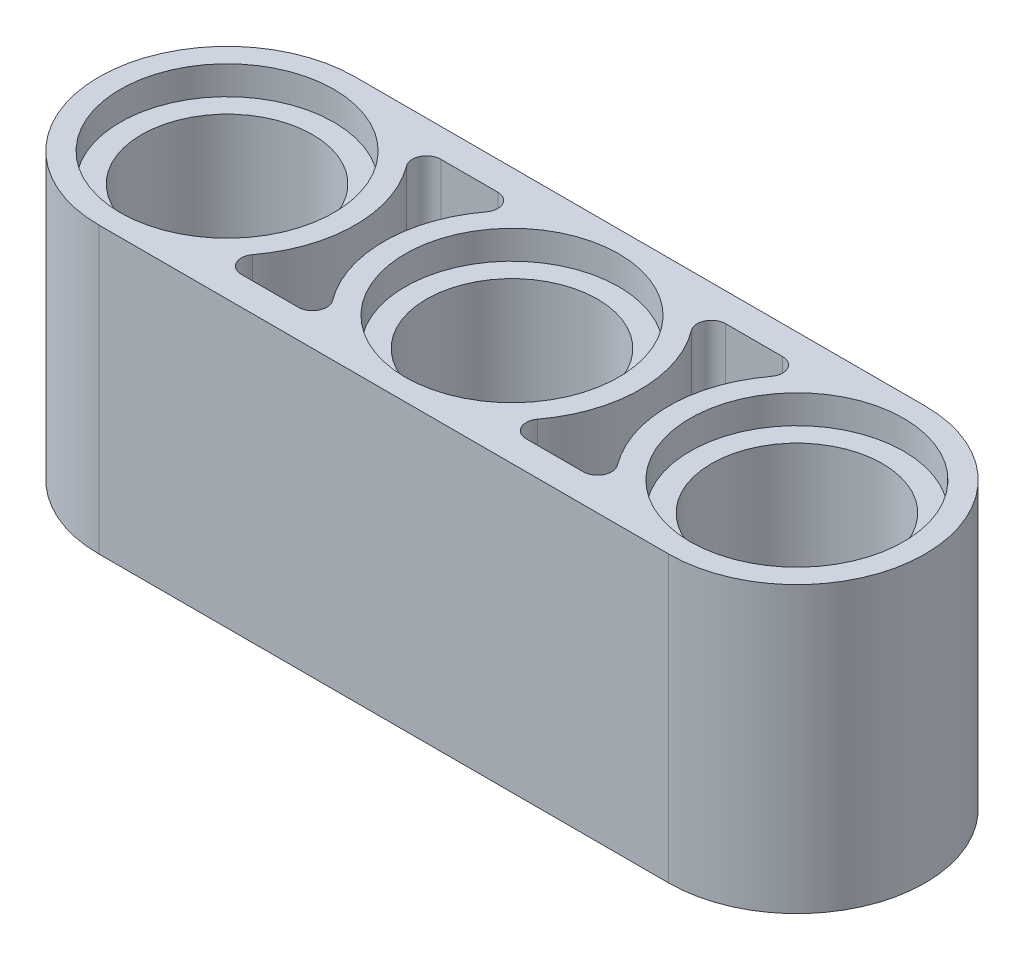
ISO-10303-21;
HEADER;
FILE_DESCRIPTION(('STEP AP214'),'2;1');
FILE_NAME('part.step','',(''),(''),'','','');
FILE_SCHEMA(('AUTOMOTIVE_DESIGN { 1 0 10303 214 1 1 1 1 }'));
ENDSEC;
DATA;
#1=APPLICATION_CONTEXT('core data for automotive mechanical design processes');
#2=APPLICATION_PROTOCOL_DEFINITION('international standard','automotive_design',2000,#1);
#3=PRODUCT_CONTEXT('',#1,'mechanical');
#4=PRODUCT('Part','Part','',(#3));
#5=PRODUCT_RELATED_PRODUCT_CATEGORY('part','',(#4));
#6=PRODUCT_DEFINITION_FORMATION('','',#4);
#7=PRODUCT_DEFINITION_CONTEXT('part definition',#1,'design');
#8=PRODUCT_DEFINITION('design','',#6,#7);
#9=PRODUCT_DEFINITION_SHAPE('','',#8);
#10=(LENGTH_UNIT() NAMED_UNIT(*) SI_UNIT(.MILLI.,.METRE.));
#11=(NAMED_UNIT(*) PLANE_ANGLE_UNIT() SI_UNIT($,.RADIAN.));
#12=(NAMED_UNIT(*) SI_UNIT($,.STERADIAN.) SOLID_ANGLE_UNIT());
#13=UNCERTAINTY_MEASURE_WITH_UNIT(LENGTH_MEASURE(1.E-05),#10,'distance_accuracy_value','');
#14=(GEOMETRIC_REPRESENTATION_CONTEXT(3) GLOBAL_UNCERTAINTY_ASSIGNED_CONTEXT((#13)) GLOBAL_UNIT_ASSIGNED_CONTEXT((#10,
#11,#12)) REPRESENTATION_CONTEXT('',''));
#15=CARTESIAN_POINT('',(0.,0.,0.));
#16=DIRECTION('',(0.,0.,1.));
#17=DIRECTION('',(1.,0.,0.));
#18=AXIS2_PLACEMENT_3D('',#15,#16,#17);
#19=CARTESIAN_POINT('',(0.,8.,-3.6));
#20=DIRECTION('',(0.,0.,1.));
#21=DIRECTION('',(1.,0.,0.));
#22=AXIS2_PLACEMENT_3D('',#19,#20,#21);
#23=PLANE('',#22);
#24=DIRECTION('',(0.,-1.,0.));
#25=VECTOR('',#24,1.);
#26=CARTESIAN_POINT('',(16.,28.8806130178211,-3.6));
#27=LINE('',#26,#25);
#28=CARTESIAN_POINT('',(16.,8.,-3.6));
#29=VERTEX_POINT('',#28);
#30=CARTESIAN_POINT('',(16.,0.,-3.6));
#31=VERTEX_POINT('',#30);
#32=EDGE_CURVE('E291',#29,#31,#27,.T.);
#33=ORIENTED_EDGE('',*,*,#32,.T.);
#34=DIRECTION('',(-1.,0.,0.));
#35=VECTOR('',#34,1.);
#36=CARTESIAN_POINT('',(0.,0.,-3.6));
#37=LINE('',#36,#35);
#38=CARTESIAN_POINT('',(0.,0.,-3.6));
#39=VERTEX_POINT('',#38);
#40=EDGE_CURVE('E313',#31,#39,#37,.T.);
#41=ORIENTED_EDGE('',*,*,#40,.T.);
#42=DIRECTION('',(0.,-1.,0.));
#43=VECTOR('',#42,1.);
#44=CARTESIAN_POINT('',(0.,8.,-3.6));
#45=LINE('',#44,#43);
#46=CARTESIAN_POINT('',(0.,8.,-3.6));
#47=VERTEX_POINT('',#46);
#48=EDGE_CURVE('E47',#47,#39,#45,.T.);
#49=ORIENTED_EDGE('',*,*,#48,.F.);
#50=DIRECTION('',(-1.,0.,0.));
#51=VECTOR('',#50,1.);
#52=CARTESIAN_POINT('',(0.,8.,-3.6));
#53=LINE('',#52,#51);
#54=EDGE_CURVE('E282',#29,#47,#53,.T.);
#55=ORIENTED_EDGE('',*,*,#54,.F.);
#56=EDGE_LOOP('',(#33,#41,#49,#55));
#57=FACE_BOUND('',#56,.T.);
#58=ADVANCED_FACE('F38',(#57),#23,.F.);
#59=CARTESIAN_POINT('',(0.,0.,0.));
#60=DIRECTION('',(0.,1.,0.));
#61=DIRECTION('',(0.,0.,1.));
#62=AXIS2_PLACEMENT_3D('',#59,#60,#61);
#63=PLANE('',#62);
#64=CARTESIAN_POINT('',(11.2,0.,2.4));
#65=DIRECTION('',(0.,1.,0.));
#66=DIRECTION('',(0.,0.,-1.));
#67=AXIS2_PLACEMENT_3D('',#64,#65,#66);
#68=CIRCLE('',#67,0.4);
#69=CARTESIAN_POINT('',(10.88,0.,2.16));
#70=VERTEX_POINT('',#69);
#71=CARTESIAN_POINT('',(11.2,0.,2.8));
#72=VERTEX_POINT('',#71);
#73=EDGE_CURVE('E63',#70,#72,#68,.T.);
#74=ORIENTED_EDGE('',*,*,#73,.T.);
#75=DIRECTION('',(1.,0.,0.));
#76=VECTOR('',#75,1.);
#77=CARTESIAN_POINT('',(12.8,0.,2.8));
#78=LINE('',#77,#76);
#79=CARTESIAN_POINT('',(12.8,0.,2.8));
#80=VERTEX_POINT('',#79);
#81=EDGE_CURVE('E574',#72,#80,#78,.T.);
#82=ORIENTED_EDGE('',*,*,#81,.T.);
#83=CARTESIAN_POINT('',(12.8,0.,2.4));
#84=DIRECTION('',(0.,1.,0.));
#85=DIRECTION('',(0.,0.,1.));
#86=AXIS2_PLACEMENT_3D('',#83,#84,#85);
#87=CIRCLE('',#86,0.4);
#88=CARTESIAN_POINT('',(13.12,0.,2.16));
#89=VERTEX_POINT('',#88);
#90=EDGE_CURVE('E605',#80,#89,#87,.T.);
#91=ORIENTED_EDGE('',*,*,#90,.T.);
#92=CARTESIAN_POINT('',(16.,0.,0.));
#93=DIRECTION('',(0.,-1.,0.));
#94=DIRECTION('',(0.,0.,1.));
#95=AXIS2_PLACEMENT_3D('',#92,#93,#94);
#96=CIRCLE('',#95,3.6);
#97=CARTESIAN_POINT('',(13.12,0.,-2.16));
#98=VERTEX_POINT('',#97);
#99=EDGE_CURVE('E602',#89,#98,#96,.T.);
#100=ORIENTED_EDGE('',*,*,#99,.T.);
#101=CARTESIAN_POINT('',(12.8,0.,-2.4));
#102=DIRECTION('',(0.,1.,0.));
#103=DIRECTION('',(0.,0.,-1.));
#104=AXIS2_PLACEMENT_3D('',#101,#102,#103);
#105=CIRCLE('',#104,0.4);
#106=CARTESIAN_POINT('',(12.8,0.,-2.8));
#107=VERTEX_POINT('',#106);
#108=EDGE_CURVE('E599',#98,#107,#105,.T.);
#109=ORIENTED_EDGE('',*,*,#108,.T.);
#110=DIRECTION('',(-1.,0.,0.));
#111=VECTOR('',#110,1.);
#112=CARTESIAN_POINT('',(11.2,0.,-2.8));
#113=LINE('',#112,#111);
#114=CARTESIAN_POINT('',(11.2,0.,-2.8));
#115=VERTEX_POINT('',#114);
#116=EDGE_CURVE('E596',#107,#115,#113,.T.);
#117=ORIENTED_EDGE('',*,*,#116,.T.);
#118=CARTESIAN_POINT('',(11.2,0.,-2.4));
#119=DIRECTION('',(0.,1.,0.));
#120=DIRECTION('',(0.,0.,1.));
#121=AXIS2_PLACEMENT_3D('',#118,#119,#120);
#122=CIRCLE('',#121,0.4);
#123=CARTESIAN_POINT('',(10.88,0.,-2.16));
#124=VERTEX_POINT('',#123);
#125=EDGE_CURVE('E593',#115,#124,#122,.T.);
#126=ORIENTED_EDGE('',*,*,#125,.T.);
#127=CARTESIAN_POINT('',(8.,0.,0.));
#128=DIRECTION('',(0.,-1.,0.));
#129=DIRECTION('',(0.,0.,1.));
#130=AXIS2_PLACEMENT_3D('',#127,#128,#129);
#131=CIRCLE('',#130,3.6);
#132=EDGE_CURVE('E590',#124,#70,#131,.T.);
#133=ORIENTED_EDGE('',*,*,#132,.T.);
#134=EDGE_LOOP('',(#74,#82,#91,#100,#109,#117,#126,#133));
#135=FACE_BOUND('',#134,.T.);
#136=CARTESIAN_POINT('',(0.,0.,0.));
#137=DIRECTION('',(0.,1.,0.));
#138=DIRECTION('',(0.,0.,1.));
#139=AXIS2_PLACEMENT_3D('',#136,#137,#138);
#140=CIRCLE('',#139,3.);
#141=CARTESIAN_POINT('',(0.,0.,3.));
#142=VERTEX_POINT('',#141);
#143=EDGE_CURVE('E345',#142,#142,#140,.T.);
#144=ORIENTED_EDGE('',*,*,#143,.T.);
#145=EDGE_LOOP('',(#144));
#146=FACE_BOUND('',#145,.T.);
#147=CARTESIAN_POINT('',(8.,0.,0.));
#148=DIRECTION('',(0.,1.,0.));
#149=DIRECTION('',(0.,0.,1.));
#150=AXIS2_PLACEMENT_3D('',#147,#148,#149);
#151=CIRCLE('',#150,3.);
#152=CARTESIAN_POINT('',(8.,0.,3.));
#153=VERTEX_POINT('',#152);
#154=EDGE_CURVE('E355',#153,#153,#151,.T.);
#155=ORIENTED_EDGE('',*,*,#154,.T.);
#156=EDGE_LOOP('',(#155));
#157=FACE_BOUND('',#156,.T.);
#158=CARTESIAN_POINT('',(16.,0.,0.));
#159=DIRECTION('',(0.,1.,0.));
#160=DIRECTION('',(0.,0.,1.));
#161=AXIS2_PLACEMENT_3D('',#158,#159,#160);
#162=CIRCLE('',#161,3.);
#163=CARTESIAN_POINT('',(16.,0.,3.));
#164=VERTEX_POINT('',#163);
#165=EDGE_CURVE('E361',#164,#164,#162,.T.);
#166=ORIENTED_EDGE('',*,*,#165,.T.);
#167=EDGE_LOOP('',(#166));
#168=FACE_BOUND('',#167,.T.);
#169=ORIENTED_EDGE('',*,*,#40,.F.);
#170=CARTESIAN_POINT('',(16.,0.,0.));
#171=DIRECTION('',(0.,-1.,0.));
#172=DIRECTION('',(0.,0.,1.));
#173=AXIS2_PLACEMENT_3D('',#170,#171,#172);
#174=CIRCLE('',#173,3.6);
#175=CARTESIAN_POINT('',(16.,0.,3.6));
#176=VERTEX_POINT('',#175);
#177=EDGE_CURVE('E293',#31,#176,#174,.T.);
#178=ORIENTED_EDGE('',*,*,#177,.T.);
#179=DIRECTION('',(1.,0.,0.));
#180=VECTOR('',#179,1.);
#181=CARTESIAN_POINT('',(32.,0.,3.6));
#182=LINE('',#181,#180);
#183=CARTESIAN_POINT('',(0.,0.,3.6));
#184=VERTEX_POINT('',#183);
#185=EDGE_CURVE('E309',#184,#176,#182,.T.);
#186=ORIENTED_EDGE('',*,*,#185,.F.);
#187=CARTESIAN_POINT('',(0.,0.,0.));
#188=DIRECTION('',(0.,1.,0.));
#189=DIRECTION('',(0.,0.,1.));
#190=AXIS2_PLACEMENT_3D('',#187,#188,#189);
#191=CIRCLE('',#190,3.6);
#192=EDGE_CURVE('E306',#39,#184,#191,.T.);
#193=ORIENTED_EDGE('',*,*,#192,.F.);
#194=EDGE_LOOP('',(#169,#178,#186,#193));
#195=FACE_BOUND('',#194,.T.);
#196=CARTESIAN_POINT('',(3.2,0.,2.4));
#197=DIRECTION('',(0.,1.,0.));
#198=DIRECTION('',(0.,0.,-1.));
#199=AXIS2_PLACEMENT_3D('',#196,#197,#198);
#200=CIRCLE('',#199,0.4);
#201=CARTESIAN_POINT('',(2.88,0.,2.16));
#202=VERTEX_POINT('',#201);
#203=CARTESIAN_POINT('',(3.2,0.,2.8));
#204=VERTEX_POINT('',#203);
#205=EDGE_CURVE('E55',#202,#204,#200,.T.);
#206=ORIENTED_EDGE('',*,*,#205,.T.);
#207=DIRECTION('',(1.,0.,0.));
#208=VECTOR('',#207,1.);
#209=CARTESIAN_POINT('',(4.8,0.,2.8));
#210=LINE('',#209,#208);
#211=CARTESIAN_POINT('',(4.8,0.,2.8));
#212=VERTEX_POINT('',#211);
#213=EDGE_CURVE('E519',#204,#212,#210,.T.);
#214=ORIENTED_EDGE('',*,*,#213,.T.);
#215=CARTESIAN_POINT('',(4.8,0.,2.4));
#216=DIRECTION('',(0.,1.,0.));
#217=DIRECTION('',(0.,0.,1.));
#218=AXIS2_PLACEMENT_3D('',#215,#216,#217);
#219=CIRCLE('',#218,0.4);
#220=CARTESIAN_POINT('',(5.12,0.,2.16));
#221=VERTEX_POINT('',#220);
#222=EDGE_CURVE('E551',#212,#221,#219,.T.);
#223=ORIENTED_EDGE('',*,*,#222,.T.);
#224=CARTESIAN_POINT('',(8.,0.,0.));
#225=DIRECTION('',(0.,-1.,0.));
#226=DIRECTION('',(0.,0.,1.));
#227=AXIS2_PLACEMENT_3D('',#224,#225,#226);
#228=CIRCLE('',#227,3.6);
#229=CARTESIAN_POINT('',(5.12,0.,-2.16));
#230=VERTEX_POINT('',#229);
#231=EDGE_CURVE('E548',#221,#230,#228,.T.);
#232=ORIENTED_EDGE('',*,*,#231,.T.);
#233=CARTESIAN_POINT('',(4.8,0.,-2.4));
#234=DIRECTION('',(0.,1.,0.));
#235=DIRECTION('',(0.,0.,-1.));
#236=AXIS2_PLACEMENT_3D('',#233,#234,#235);
#237=CIRCLE('',#236,0.4);
#238=CARTESIAN_POINT('',(4.8,0.,-2.8));
#239=VERTEX_POINT('',#238);
#240=EDGE_CURVE('E545',#230,#239,#237,.T.);
#241=ORIENTED_EDGE('',*,*,#240,.T.);
#242=DIRECTION('',(-1.,0.,0.));
#243=VECTOR('',#242,1.);
#244=CARTESIAN_POINT('',(3.2,0.,-2.8));
#245=LINE('',#244,#243);
#246=CARTESIAN_POINT('',(3.2,0.,-2.8));
#247=VERTEX_POINT('',#246);
#248=EDGE_CURVE('E542',#239,#247,#245,.T.);
#249=ORIENTED_EDGE('',*,*,#248,.T.);
#250=CARTESIAN_POINT('',(3.2,0.,-2.4));
#251=DIRECTION('',(0.,1.,0.));
#252=DIRECTION('',(0.,0.,1.));
#253=AXIS2_PLACEMENT_3D('',#250,#251,#252);
#254=CIRCLE('',#253,0.4);
#255=CARTESIAN_POINT('',(2.88,0.,-2.16));
#256=VERTEX_POINT('',#255);
#257=EDGE_CURVE('E539',#247,#256,#254,.T.);
#258=ORIENTED_EDGE('',*,*,#257,.T.);
#259=CARTESIAN_POINT('',(0.,0.,0.));
#260=DIRECTION('',(0.,-1.,0.));
#261=DIRECTION('',(0.,0.,1.));
#262=AXIS2_PLACEMENT_3D('',#259,#260,#261);
#263=CIRCLE('',#262,3.6);
#264=EDGE_CURVE('E535',#256,#202,#263,.T.);
#265=ORIENTED_EDGE('',*,*,#264,.T.);
#266=EDGE_LOOP('',(#206,#214,#223,#232,#241,#249,#258,#265));
#267=FACE_BOUND('',#266,.T.);
#268=ADVANCED_FACE('F629',(#135,#146,#157,#168,#195,#267),#63,.F.);
#269=CARTESIAN_POINT('',(0.,8.,0.));
#270=DIRECTION('',(0.,-1.,0.));
#271=DIRECTION('',(0.,0.,-1.));
#272=AXIS2_PLACEMENT_3D('',#269,#270,#271);
#273=CYLINDRICAL_SURFACE('',#272,2.4);
#274=CARTESIAN_POINT('',(0.,7.2,0.));
#275=DIRECTION('',(0.,1.,0.));
#276=DIRECTION('',(0.,0.,1.));
#277=AXIS2_PLACEMENT_3D('',#274,#275,#276);
#278=CIRCLE('',#277,2.4);
#279=CARTESIAN_POINT('',(0.,7.2,2.4));
#280=VERTEX_POINT('',#279);
#281=EDGE_CURVE('E310',#280,#280,#278,.T.);
#282=ORIENTED_EDGE('',*,*,#281,.T.);
#283=EDGE_LOOP('',(#282));
#284=FACE_BOUND('',#283,.T.);
#285=CARTESIAN_POINT('',(0.,0.8,0.));
#286=DIRECTION('',(0.,-1.,0.));
#287=DIRECTION('',(0.,0.,-1.));
#288=AXIS2_PLACEMENT_3D('',#285,#286,#287);
#289=CIRCLE('',#288,2.4);
#290=CARTESIAN_POINT('',(0.,0.8,-2.4));
#291=VERTEX_POINT('',#290);
#292=EDGE_CURVE('E42',#291,#291,#289,.T.);
#293=ORIENTED_EDGE('',*,*,#292,.T.);
#294=EDGE_LOOP('',(#293));
#295=FACE_BOUND('',#294,.T.);
#296=ADVANCED_FACE('F334',(#284,#295),#273,.F.);
#297=CARTESIAN_POINT('',(8.,8.,0.));
#298=DIRECTION('',(0.,-1.,0.));
#299=DIRECTION('',(0.,0.,-1.));
#300=AXIS2_PLACEMENT_3D('',#297,#298,#299);
#301=CYLINDRICAL_SURFACE('',#300,2.4);
#302=CARTESIAN_POINT('',(8.,7.2,0.));
#303=DIRECTION('',(0.,1.,0.));
#304=DIRECTION('',(0.,0.,1.));
#305=AXIS2_PLACEMENT_3D('',#302,#303,#304);
#306=CIRCLE('',#305,2.4);
#307=CARTESIAN_POINT('',(8.,7.2,2.4));
#308=VERTEX_POINT('',#307);
#309=EDGE_CURVE('E318',#308,#308,#306,.T.);
#310=ORIENTED_EDGE('',*,*,#309,.T.);
#311=EDGE_LOOP('',(#310));
#312=FACE_BOUND('',#311,.T.);
#313=CARTESIAN_POINT('',(8.,0.8,0.));
#314=DIRECTION('',(0.,-1.,0.));
#315=DIRECTION('',(0.,0.,-1.));
#316=AXIS2_PLACEMENT_3D('',#313,#314,#315);
#317=CIRCLE('',#316,2.4);
#318=CARTESIAN_POINT('',(8.,0.8,-2.4));
#319=VERTEX_POINT('',#318);
#320=EDGE_CURVE('E326',#319,#319,#317,.T.);
#321=ORIENTED_EDGE('',*,*,#320,.T.);
#322=EDGE_LOOP('',(#321));
#323=FACE_BOUND('',#322,.T.);
#324=ADVANCED_FACE('F692',(#312,#323),#301,.F.);
#325=CARTESIAN_POINT('',(16.,8.,0.));
#326=DIRECTION('',(0.,-1.,0.));
#327=DIRECTION('',(0.,0.,-1.));
#328=AXIS2_PLACEMENT_3D('',#325,#326,#327);
#329=CYLINDRICAL_SURFACE('',#328,2.4);
#330=CARTESIAN_POINT('',(16.,7.2,0.));
#331=DIRECTION('',(0.,1.,0.));
#332=DIRECTION('',(0.,0.,1.));
#333=AXIS2_PLACEMENT_3D('',#330,#331,#332);
#334=CIRCLE('',#333,2.4);
#335=CARTESIAN_POINT('',(16.,7.2,2.4));
#336=VERTEX_POINT('',#335);
#337=EDGE_CURVE('E315',#336,#336,#334,.T.);
#338=ORIENTED_EDGE('',*,*,#337,.T.);
#339=EDGE_LOOP('',(#338));
#340=FACE_BOUND('',#339,.T.);
#341=CARTESIAN_POINT('',(16.,0.8,0.));
#342=DIRECTION('',(0.,-1.,0.));
#343=DIRECTION('',(0.,0.,-1.));
#344=AXIS2_PLACEMENT_3D('',#341,#342,#343);
#345=CIRCLE('',#344,2.4);
#346=CARTESIAN_POINT('',(16.,0.8,-2.4));
#347=VERTEX_POINT('',#346);
#348=EDGE_CURVE('E324',#347,#347,#345,.T.);
#349=ORIENTED_EDGE('',*,*,#348,.T.);
#350=EDGE_LOOP('',(#349));
#351=FACE_BOUND('',#350,.T.);
#352=ADVANCED_FACE('F688',(#340,#351),#329,.F.);
#353=CARTESIAN_POINT('',(0.,8.,0.));
#354=DIRECTION('',(0.,1.,0.));
#355=DIRECTION('',(0.,0.,1.));
#356=AXIS2_PLACEMENT_3D('',#353,#354,#355);
#357=PLANE('',#356);
#358=CARTESIAN_POINT('',(16.,8.,0.));
#359=DIRECTION('',(0.,-1.,0.));
#360=DIRECTION('',(0.,0.,1.));
#361=AXIS2_PLACEMENT_3D('',#358,#359,#360);
#362=CIRCLE('',#361,3.6);
#363=CARTESIAN_POINT('',(16.,8.,3.6));
#364=VERTEX_POINT('',#363);
#365=EDGE_CURVE('E276',#29,#364,#362,.T.);
#366=ORIENTED_EDGE('',*,*,#365,.F.);
#367=ORIENTED_EDGE('',*,*,#54,.T.);
#368=CARTESIAN_POINT('',(0.,8.,0.));
#369=DIRECTION('',(0.,1.,0.));
#370=DIRECTION('',(0.,0.,1.));
#371=AXIS2_PLACEMENT_3D('',#368,#369,#370);
#372=CIRCLE('',#371,3.6);
#373=CARTESIAN_POINT('',(0.,8.,3.6));
#374=VERTEX_POINT('',#373);
#375=EDGE_CURVE('E302',#47,#374,#372,.T.);
#376=ORIENTED_EDGE('',*,*,#375,.T.);
#377=DIRECTION('',(1.,0.,0.));
#378=VECTOR('',#377,1.);
#379=CARTESIAN_POINT('',(32.,8.,3.6));
#380=LINE('',#379,#378);
#381=EDGE_CURVE('E284',#374,#364,#380,.T.);
#382=ORIENTED_EDGE('',*,*,#381,.T.);
#383=EDGE_LOOP('',(#366,#367,#376,#382));
#384=FACE_BOUND('',#383,.T.);
#385=CARTESIAN_POINT('',(3.2,8.,2.4));
#386=DIRECTION('',(0.,1.,0.));
#387=DIRECTION('',(0.,0.,-1.));
#388=AXIS2_PLACEMENT_3D('',#385,#386,#387);
#389=CIRCLE('',#388,0.4);
#390=CARTESIAN_POINT('',(2.88,8.,2.16));
#391=VERTEX_POINT('',#390);
#392=CARTESIAN_POINT('',(3.2,8.,2.8));
#393=VERTEX_POINT('',#392);
#394=EDGE_CURVE('E391',#391,#393,#389,.T.);
#395=ORIENTED_EDGE('',*,*,#394,.F.);
#396=CARTESIAN_POINT('',(0.,8.,0.));
#397=DIRECTION('',(0.,-1.,0.));
#398=DIRECTION('',(0.,0.,1.));
#399=AXIS2_PLACEMENT_3D('',#396,#397,#398);
#400=CIRCLE('',#399,3.6);
#401=CARTESIAN_POINT('',(2.88,8.,-2.16));
#402=VERTEX_POINT('',#401);
#403=EDGE_CURVE('E369',#402,#391,#400,.T.);
#404=ORIENTED_EDGE('',*,*,#403,.F.);
#405=CARTESIAN_POINT('',(3.2,8.,-2.4));
#406=DIRECTION('',(0.,1.,0.));
#407=DIRECTION('',(0.,0.,1.));
#408=AXIS2_PLACEMENT_3D('',#405,#406,#407);
#409=CIRCLE('',#408,0.4);
#410=CARTESIAN_POINT('',(3.2,8.,-2.8));
#411=VERTEX_POINT('',#410);
#412=EDGE_CURVE('E409',#411,#402,#409,.T.);
#413=ORIENTED_EDGE('',*,*,#412,.F.);
#414=DIRECTION('',(-1.,0.,0.));
#415=VECTOR('',#414,1.);
#416=CARTESIAN_POINT('',(3.2,8.,-2.8));
#417=LINE('',#416,#415);
#418=CARTESIAN_POINT('',(4.8,8.,-2.8));
#419=VERTEX_POINT('',#418);
#420=EDGE_CURVE('E406',#419,#411,#417,.T.);
#421=ORIENTED_EDGE('',*,*,#420,.F.);
#422=CARTESIAN_POINT('',(4.8,8.,-2.4));
#423=DIRECTION('',(0.,1.,0.));
#424=DIRECTION('',(0.,0.,-1.));
#425=AXIS2_PLACEMENT_3D('',#422,#423,#424);
#426=CIRCLE('',#425,0.4);
#427=CARTESIAN_POINT('',(5.12,8.,-2.16));
#428=VERTEX_POINT('',#427);
#429=EDGE_CURVE('E403',#428,#419,#426,.T.);
#430=ORIENTED_EDGE('',*,*,#429,.F.);
#431=CARTESIAN_POINT('',(8.,8.,0.));
#432=DIRECTION('',(0.,-1.,0.));
#433=DIRECTION('',(0.,0.,1.));
#434=AXIS2_PLACEMENT_3D('',#431,#432,#433);
#435=CIRCLE('',#434,3.6);
#436=CARTESIAN_POINT('',(5.12,8.,2.16));
#437=VERTEX_POINT('',#436);
#438=EDGE_CURVE('E400',#437,#428,#435,.T.);
#439=ORIENTED_EDGE('',*,*,#438,.F.);
#440=CARTESIAN_POINT('',(4.8,8.,2.4));
#441=DIRECTION('',(0.,1.,0.));
#442=DIRECTION('',(0.,0.,1.));
#443=AXIS2_PLACEMENT_3D('',#440,#441,#442);
#444=CIRCLE('',#443,0.4);
#445=CARTESIAN_POINT('',(4.8,8.,2.8));
#446=VERTEX_POINT('',#445);
#447=EDGE_CURVE('E397',#446,#437,#444,.T.);
#448=ORIENTED_EDGE('',*,*,#447,.F.);
#449=DIRECTION('',(1.,0.,0.));
#450=VECTOR('',#449,1.);
#451=CARTESIAN_POINT('',(4.8,8.,2.8));
#452=LINE('',#451,#450);
#453=EDGE_CURVE('E393',#393,#446,#452,.T.);
#454=ORIENTED_EDGE('',*,*,#453,.F.);
#455=EDGE_LOOP('',(#395,#404,#413,#421,#430,#439,#448,#454));
#456=FACE_BOUND('',#455,.T.);
#457=CARTESIAN_POINT('',(11.2,8.,2.4));
#458=DIRECTION('',(0.,1.,0.));
#459=DIRECTION('',(0.,0.,-1.));
#460=AXIS2_PLACEMENT_3D('',#457,#458,#459);
#461=CIRCLE('',#460,0.4);
#462=CARTESIAN_POINT('',(10.88,8.,2.16));
#463=VERTEX_POINT('',#462);
#464=CARTESIAN_POINT('',(11.2,8.,2.8));
#465=VERTEX_POINT('',#464);
#466=EDGE_CURVE('E288',#463,#465,#461,.T.);
#467=ORIENTED_EDGE('',*,*,#466,.F.);
#468=CARTESIAN_POINT('',(8.,8.,0.));
#469=DIRECTION('',(0.,-1.,0.));
#470=DIRECTION('',(0.,0.,1.));
#471=AXIS2_PLACEMENT_3D('',#468,#469,#470);
#472=CIRCLE('',#471,3.6);
#473=CARTESIAN_POINT('',(10.88,8.,-2.16));
#474=VERTEX_POINT('',#473);
#475=EDGE_CURVE('E435',#474,#463,#472,.T.);
#476=ORIENTED_EDGE('',*,*,#475,.F.);
#477=CARTESIAN_POINT('',(11.2,8.,-2.4));
#478=DIRECTION('',(0.,1.,0.));
#479=DIRECTION('',(0.,0.,1.));
#480=AXIS2_PLACEMENT_3D('',#477,#478,#479);
#481=CIRCLE('',#480,0.4);
#482=CARTESIAN_POINT('',(11.2,8.,-2.8));
#483=VERTEX_POINT('',#482);
#484=EDGE_CURVE('E473',#483,#474,#481,.T.);
#485=ORIENTED_EDGE('',*,*,#484,.F.);
#486=DIRECTION('',(-1.,0.,0.));
#487=VECTOR('',#486,1.);
#488=CARTESIAN_POINT('',(11.2,8.,-2.8));
#489=LINE('',#488,#487);
#490=CARTESIAN_POINT('',(12.8,8.,-2.8));
#491=VERTEX_POINT('',#490);
#492=EDGE_CURVE('E470',#491,#483,#489,.T.);
#493=ORIENTED_EDGE('',*,*,#492,.F.);
#494=CARTESIAN_POINT('',(12.8,8.,-2.4));
#495=DIRECTION('',(0.,1.,0.));
#496=DIRECTION('',(0.,0.,-1.));
#497=AXIS2_PLACEMENT_3D('',#494,#495,#496);
#498=CIRCLE('',#497,0.4);
#499=CARTESIAN_POINT('',(13.12,8.,-2.16));
#500=VERTEX_POINT('',#499);
#501=EDGE_CURVE('E467',#500,#491,#498,.T.);
#502=ORIENTED_EDGE('',*,*,#501,.F.);
#503=CARTESIAN_POINT('',(16.,8.,0.));
#504=DIRECTION('',(0.,-1.,0.));
#505=DIRECTION('',(0.,0.,1.));
#506=AXIS2_PLACEMENT_3D('',#503,#504,#505);
#507=CIRCLE('',#506,3.6);
#508=CARTESIAN_POINT('',(13.12,8.,2.16));
#509=VERTEX_POINT('',#508);
#510=EDGE_CURVE('E464',#509,#500,#507,.T.);
#511=ORIENTED_EDGE('',*,*,#510,.F.);
#512=CARTESIAN_POINT('',(12.8,8.,2.4));
#513=DIRECTION('',(0.,1.,0.));
#514=DIRECTION('',(0.,0.,1.));
#515=AXIS2_PLACEMENT_3D('',#512,#513,#514);
#516=CIRCLE('',#515,0.4);
#517=CARTESIAN_POINT('',(12.8,8.,2.8));
#518=VERTEX_POINT('',#517);
#519=EDGE_CURVE('E461',#518,#509,#516,.T.);
#520=ORIENTED_EDGE('',*,*,#519,.F.);
#521=DIRECTION('',(1.,0.,0.));
#522=VECTOR('',#521,1.);
#523=CARTESIAN_POINT('',(12.8,8.,2.8));
#524=LINE('',#523,#522);
#525=EDGE_CURVE('E458',#465,#518,#524,.T.);
#526=ORIENTED_EDGE('',*,*,#525,.F.);
#527=EDGE_LOOP('',(#467,#476,#485,#493,#502,#511,#520,#526));
#528=FACE_BOUND('',#527,.T.);
#529=CARTESIAN_POINT('',(0.,8.,0.));
#530=DIRECTION('',(0.,1.,0.));
#531=DIRECTION('',(0.,0.,1.));
#532=AXIS2_PLACEMENT_3D('',#529,#530,#531);
#533=CIRCLE('',#532,3.);
#534=CARTESIAN_POINT('',(0.,8.,3.));
#535=VERTEX_POINT('',#534);
#536=EDGE_CURVE('E495',#535,#535,#533,.T.);
#537=ORIENTED_EDGE('',*,*,#536,.F.);
#538=EDGE_LOOP('',(#537));
#539=FACE_BOUND('',#538,.T.);
#540=CARTESIAN_POINT('',(8.,8.,0.));
#541=DIRECTION('',(0.,1.,0.));
#542=DIRECTION('',(0.,0.,1.));
#543=AXIS2_PLACEMENT_3D('',#540,#541,#542);
#544=CIRCLE('',#543,3.);
#545=CARTESIAN_POINT('',(8.,8.,3.));
#546=VERTEX_POINT('',#545);
#547=EDGE_CURVE('E501',#546,#546,#544,.T.);
#548=ORIENTED_EDGE('',*,*,#547,.F.);
#549=EDGE_LOOP('',(#548));
#550=FACE_BOUND('',#549,.T.);
#551=CARTESIAN_POINT('',(16.,8.,0.));
#552=DIRECTION('',(0.,1.,0.));
#553=DIRECTION('',(0.,0.,1.));
#554=AXIS2_PLACEMENT_3D('',#551,#552,#553);
#555=CIRCLE('',#554,3.);
#556=CARTESIAN_POINT('',(16.,8.,3.));
#557=VERTEX_POINT('',#556);
#558=EDGE_CURVE('E416',#557,#557,#555,.T.);
#559=ORIENTED_EDGE('',*,*,#558,.F.);
#560=EDGE_LOOP('',(#559));
#561=FACE_BOUND('',#560,.T.);
#562=ADVANCED_FACE('F278',(#384,#456,#528,#539,#550,#561),#357,.T.);
#563=CARTESIAN_POINT('',(0.,8.,0.));
#564=DIRECTION('',(0.,-1.,0.));
#565=DIRECTION('',(0.,0.,-1.));
#566=AXIS2_PLACEMENT_3D('',#563,#564,#565);
#567=CYLINDRICAL_SURFACE('',#566,3.6);
#568=ORIENTED_EDGE('',*,*,#192,.T.);
#569=DIRECTION('',(0.,-1.,0.));
#570=VECTOR('',#569,1.);
#571=CARTESIAN_POINT('',(0.,8.,3.6));
#572=LINE('',#571,#570);
#573=EDGE_CURVE('E11',#374,#184,#572,.T.);
#574=ORIENTED_EDGE('',*,*,#573,.F.);
#575=ORIENTED_EDGE('',*,*,#375,.F.);
#576=ORIENTED_EDGE('',*,*,#48,.T.);
#577=EDGE_LOOP('',(#568,#574,#575,#576));
#578=FACE_BOUND('',#577,.T.);
#579=ADVANCED_FACE('F40',(#578),#567,.T.);
#580=CARTESIAN_POINT('',(32.,8.,3.6));
#581=DIRECTION('',(0.,0.,-1.));
#582=DIRECTION('',(-1.,0.,0.));
#583=AXIS2_PLACEMENT_3D('',#580,#581,#582);
#584=PLANE('',#583);
#585=ORIENTED_EDGE('',*,*,#185,.T.);
#586=DIRECTION('',(0.,-1.,0.));
#587=VECTOR('',#586,1.);
#588=CARTESIAN_POINT('',(16.,28.8806130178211,3.6));
#589=LINE('',#588,#587);
#590=EDGE_CURVE('E296',#364,#176,#589,.T.);
#591=ORIENTED_EDGE('',*,*,#590,.F.);
#592=ORIENTED_EDGE('',*,*,#381,.F.);
#593=ORIENTED_EDGE('',*,*,#573,.T.);
#594=EDGE_LOOP('',(#585,#591,#592,#593));
#595=FACE_BOUND('',#594,.T.);
#596=ADVANCED_FACE('F512',(#595),#584,.F.);
#597=CARTESIAN_POINT('',(16.,7.2,0.));
#598=DIRECTION('',(0.,1.,0.));
#599=DIRECTION('',(0.,0.,1.));
#600=AXIS2_PLACEMENT_3D('',#597,#598,#599);
#601=CYLINDRICAL_SURFACE('',#600,3.);
#602=CARTESIAN_POINT('',(16.,7.2,0.));
#603=DIRECTION('',(0.,1.,0.));
#604=DIRECTION('',(0.,0.,1.));
#605=AXIS2_PLACEMENT_3D('',#602,#603,#604);
#606=CIRCLE('',#605,3.);
#607=CARTESIAN_POINT('',(16.,7.2,3.));
#608=VERTEX_POINT('',#607);
#609=EDGE_CURVE('E504',#608,#608,#606,.T.);
#610=ORIENTED_EDGE('',*,*,#609,.F.);
#611=EDGE_LOOP('',(#610));
#612=FACE_BOUND('',#611,.T.);
#613=ORIENTED_EDGE('',*,*,#558,.T.);
#614=EDGE_LOOP('',(#613));
#615=FACE_BOUND('',#614,.T.);
#616=ADVANCED_FACE('F677',(#612,#615),#601,.F.);
#617=CARTESIAN_POINT('',(16.,7.2,0.));
#618=DIRECTION('',(0.,1.,0.));
#619=DIRECTION('',(0.,0.,1.));
#620=AXIS2_PLACEMENT_3D('',#617,#618,#619);
#621=PLANE('',#620);
#622=ORIENTED_EDGE('',*,*,#337,.F.);
#623=EDGE_LOOP('',(#622));
#624=FACE_BOUND('',#623,.T.);
#625=ORIENTED_EDGE('',*,*,#609,.T.);
#626=EDGE_LOOP('',(#625));
#627=FACE_BOUND('',#626,.T.);
#628=ADVANCED_FACE('F682',(#624,#627),#621,.T.);
#629=CARTESIAN_POINT('',(8.,7.2,0.));
#630=DIRECTION('',(0.,1.,0.));
#631=DIRECTION('',(0.,0.,1.));
#632=AXIS2_PLACEMENT_3D('',#629,#630,#631);
#633=CYLINDRICAL_SURFACE('',#632,3.);
#634=CARTESIAN_POINT('',(8.,7.2,0.));
#635=DIRECTION('',(0.,1.,0.));
#636=DIRECTION('',(0.,0.,1.));
#637=AXIS2_PLACEMENT_3D('',#634,#635,#636);
#638=CIRCLE('',#637,3.);
#639=CARTESIAN_POINT('',(8.,7.2,3.));
#640=VERTEX_POINT('',#639);
#641=EDGE_CURVE('E498',#640,#640,#638,.T.);
#642=ORIENTED_EDGE('',*,*,#641,.F.);
#643=EDGE_LOOP('',(#642));
#644=FACE_BOUND('',#643,.T.);
#645=ORIENTED_EDGE('',*,*,#547,.T.);
#646=EDGE_LOOP('',(#645));
#647=FACE_BOUND('',#646,.T.);
#648=ADVANCED_FACE('F704',(#644,#647),#633,.F.);
#649=CARTESIAN_POINT('',(8.,7.2,0.));
#650=DIRECTION('',(0.,1.,0.));
#651=DIRECTION('',(0.,0.,1.));
#652=AXIS2_PLACEMENT_3D('',#649,#650,#651);
#653=PLANE('',#652);
#654=ORIENTED_EDGE('',*,*,#309,.F.);
#655=EDGE_LOOP('',(#654));
#656=FACE_BOUND('',#655,.T.);
#657=ORIENTED_EDGE('',*,*,#641,.T.);
#658=EDGE_LOOP('',(#657));
#659=FACE_BOUND('',#658,.T.);
#660=ADVANCED_FACE('F708',(#656,#659),#653,.T.);
#661=CARTESIAN_POINT('',(0.,7.2,0.));
#662=DIRECTION('',(0.,1.,0.));
#663=DIRECTION('',(0.,0.,1.));
#664=AXIS2_PLACEMENT_3D('',#661,#662,#663);
#665=CYLINDRICAL_SURFACE('',#664,3.);
#666=CARTESIAN_POINT('',(0.,7.2,0.));
#667=DIRECTION('',(0.,1.,0.));
#668=DIRECTION('',(0.,0.,1.));
#669=AXIS2_PLACEMENT_3D('',#666,#667,#668);
#670=CIRCLE('',#669,3.);
#671=CARTESIAN_POINT('',(0.,7.2,3.));
#672=VERTEX_POINT('',#671);
#673=EDGE_CURVE('E319',#672,#672,#670,.T.);
#674=ORIENTED_EDGE('',*,*,#673,.F.);
#675=EDGE_LOOP('',(#674));
#676=FACE_BOUND('',#675,.T.);
#677=ORIENTED_EDGE('',*,*,#536,.T.);
#678=EDGE_LOOP('',(#677));
#679=FACE_BOUND('',#678,.T.);
#680=ADVANCED_FACE('F712',(#676,#679),#665,.F.);
#681=CARTESIAN_POINT('',(0.,7.2,0.));
#682=DIRECTION('',(0.,1.,0.));
#683=DIRECTION('',(0.,0.,1.));
#684=AXIS2_PLACEMENT_3D('',#681,#682,#683);
#685=PLANE('',#684);
#686=ORIENTED_EDGE('',*,*,#281,.F.);
#687=EDGE_LOOP('',(#686));
#688=FACE_BOUND('',#687,.T.);
#689=ORIENTED_EDGE('',*,*,#673,.T.);
#690=EDGE_LOOP('',(#689));
#691=FACE_BOUND('',#690,.T.);
#692=ADVANCED_FACE('F716',(#688,#691),#685,.T.);
#693=CARTESIAN_POINT('',(16.,4.8,0.));
#694=DIRECTION('',(0.,1.,0.));
#695=DIRECTION('',(0.,0.,1.));
#696=AXIS2_PLACEMENT_3D('',#693,#694,#695);
#697=CYLINDRICAL_SURFACE('',#696,3.6);
#698=ORIENTED_EDGE('',*,*,#365,.T.);
#699=ORIENTED_EDGE('',*,*,#590,.T.);
#700=ORIENTED_EDGE('',*,*,#177,.F.);
#701=ORIENTED_EDGE('',*,*,#32,.F.);
#702=EDGE_LOOP('',(#698,#699,#700,#701));
#703=FACE_BOUND('',#702,.T.);
#704=ADVANCED_FACE('F292',(#703),#697,.T.);
#705=CARTESIAN_POINT('',(11.2,4.8,2.4));
#706=DIRECTION('',(0.,1.,0.));
#707=DIRECTION('',(0.,0.,1.));
#708=AXIS2_PLACEMENT_3D('',#705,#706,#707);
#709=CYLINDRICAL_SURFACE('',#708,0.4);
#710=ORIENTED_EDGE('',*,*,#466,.T.);
#711=DIRECTION('',(0.,1.,0.));
#712=VECTOR('',#711,1.);
#713=CARTESIAN_POINT('',(11.2,4.8,2.8));
#714=LINE('',#713,#712);
#715=CARTESIAN_POINT('',(11.2,4.8,2.8));
#716=VERTEX_POINT('',#715);
#717=EDGE_CURVE('E456',#716,#465,#714,.T.);
#718=ORIENTED_EDGE('',*,*,#717,.F.);
#719=CARTESIAN_POINT('',(11.2,4.8,2.4));
#720=DIRECTION('',(0.,1.,0.));
#721=DIRECTION('',(0.,0.,-1.));
#722=AXIS2_PLACEMENT_3D('',#719,#720,#721);
#723=CIRCLE('',#722,0.4);
#724=CARTESIAN_POINT('',(10.88,4.8,2.16));
#725=VERTEX_POINT('',#724);
#726=EDGE_CURVE('E431',#725,#716,#723,.T.);
#727=ORIENTED_EDGE('',*,*,#726,.F.);
#728=DIRECTION('',(0.,1.,0.));
#729=VECTOR('',#728,1.);
#730=CARTESIAN_POINT('',(10.88,4.8,2.16));
#731=LINE('',#730,#729);
#732=EDGE_CURVE('E394',#725,#463,#731,.T.);
#733=ORIENTED_EDGE('',*,*,#732,.T.);
#734=EDGE_LOOP('',(#710,#718,#727,#733));
#735=FACE_BOUND('',#734,.T.);
#736=ADVANCED_FACE('F723',(#735),#709,.F.);
#737=CARTESIAN_POINT('',(8.,4.8,0.));
#738=DIRECTION('',(0.,1.,0.));
#739=DIRECTION('',(0.,0.,1.));
#740=AXIS2_PLACEMENT_3D('',#737,#738,#739);
#741=CYLINDRICAL_SURFACE('',#740,3.6);
#742=ORIENTED_EDGE('',*,*,#475,.T.);
#743=ORIENTED_EDGE('',*,*,#732,.F.);
#744=CARTESIAN_POINT('',(8.,4.8,0.));
#745=DIRECTION('',(0.,-1.,0.));
#746=DIRECTION('',(0.,0.,1.));
#747=AXIS2_PLACEMENT_3D('',#744,#745,#746);
#748=CIRCLE('',#747,3.6);
#749=CARTESIAN_POINT('',(10.88,4.8,-2.16));
#750=VERTEX_POINT('',#749);
#751=EDGE_CURVE('E453',#750,#725,#748,.T.);
#752=ORIENTED_EDGE('',*,*,#751,.F.);
#753=DIRECTION('',(0.,1.,0.));
#754=VECTOR('',#753,1.);
#755=CARTESIAN_POINT('',(10.88,4.8,-2.16));
#756=LINE('',#755,#754);
#757=EDGE_CURVE('E479',#750,#474,#756,.T.);
#758=ORIENTED_EDGE('',*,*,#757,.T.);
#759=EDGE_LOOP('',(#742,#743,#752,#758));
#760=FACE_BOUND('',#759,.T.);
#761=ADVANCED_FACE('F726',(#760),#741,.T.);
#762=CARTESIAN_POINT('',(11.2,4.8,-2.4));
#763=DIRECTION('',(0.,1.,0.));
#764=DIRECTION('',(0.,0.,1.));
#765=AXIS2_PLACEMENT_3D('',#762,#763,#764);
#766=CYLINDRICAL_SURFACE('',#765,0.4);
#767=ORIENTED_EDGE('',*,*,#484,.T.);
#768=ORIENTED_EDGE('',*,*,#757,.F.);
#769=CARTESIAN_POINT('',(11.2,4.8,-2.4));
#770=DIRECTION('',(0.,1.,0.));
#771=DIRECTION('',(0.,0.,1.));
#772=AXIS2_PLACEMENT_3D('',#769,#770,#771);
#773=CIRCLE('',#772,0.4);
#774=CARTESIAN_POINT('',(11.2,4.8,-2.8));
#775=VERTEX_POINT('',#774);
#776=EDGE_CURVE('E450',#775,#750,#773,.T.);
#777=ORIENTED_EDGE('',*,*,#776,.F.);
#778=DIRECTION('',(0.,1.,0.));
#779=VECTOR('',#778,1.);
#780=CARTESIAN_POINT('',(11.2,4.8,-2.8));
#781=LINE('',#780,#779);
#782=EDGE_CURVE('E481',#775,#483,#781,.T.);
#783=ORIENTED_EDGE('',*,*,#782,.T.);
#784=EDGE_LOOP('',(#767,#768,#777,#783));
#785=FACE_BOUND('',#784,.T.);
#786=ADVANCED_FACE('F748',(#785),#766,.F.);
#787=CARTESIAN_POINT('',(11.2,4.8,-2.8));
#788=DIRECTION('',(0.,0.,-1.));
#789=DIRECTION('',(-1.,0.,0.));
#790=AXIS2_PLACEMENT_3D('',#787,#788,#789);
#791=PLANE('',#790);
#792=ORIENTED_EDGE('',*,*,#492,.T.);
#793=ORIENTED_EDGE('',*,*,#782,.F.);
#794=DIRECTION('',(-1.,0.,0.));
#795=VECTOR('',#794,1.);
#796=CARTESIAN_POINT('',(11.2,4.8,-2.8));
#797=LINE('',#796,#795);
#798=CARTESIAN_POINT('',(12.8,4.8,-2.8));
#799=VERTEX_POINT('',#798);
#800=EDGE_CURVE('E447',#799,#775,#797,.T.);
#801=ORIENTED_EDGE('',*,*,#800,.F.);
#802=DIRECTION('',(0.,1.,0.));
#803=VECTOR('',#802,1.);
#804=CARTESIAN_POINT('',(12.8,4.8,-2.8));
#805=LINE('',#804,#803);
#806=EDGE_CURVE('E483',#799,#491,#805,.T.);
#807=ORIENTED_EDGE('',*,*,#806,.T.);
#808=EDGE_LOOP('',(#792,#793,#801,#807));
#809=FACE_BOUND('',#808,.T.);
#810=ADVANCED_FACE('F744',(#809),#791,.F.);
#811=CARTESIAN_POINT('',(12.8,4.8,-2.4));
#812=DIRECTION('',(0.,1.,0.));
#813=DIRECTION('',(0.,0.,1.));
#814=AXIS2_PLACEMENT_3D('',#811,#812,#813);
#815=CYLINDRICAL_SURFACE('',#814,0.4);
#816=ORIENTED_EDGE('',*,*,#501,.T.);
#817=ORIENTED_EDGE('',*,*,#806,.F.);
#818=CARTESIAN_POINT('',(12.8,4.8,-2.4));
#819=DIRECTION('',(0.,1.,0.));
#820=DIRECTION('',(0.,0.,-1.));
#821=AXIS2_PLACEMENT_3D('',#818,#819,#820);
#822=CIRCLE('',#821,0.4);
#823=CARTESIAN_POINT('',(13.12,4.8,-2.16));
#824=VERTEX_POINT('',#823);
#825=EDGE_CURVE('E444',#824,#799,#822,.T.);
#826=ORIENTED_EDGE('',*,*,#825,.F.);
#827=DIRECTION('',(0.,1.,0.));
#828=VECTOR('',#827,1.);
#829=CARTESIAN_POINT('',(13.12,4.8,-2.16));
#830=LINE('',#829,#828);
#831=EDGE_CURVE('E485',#824,#500,#830,.T.);
#832=ORIENTED_EDGE('',*,*,#831,.T.);
#833=EDGE_LOOP('',(#816,#817,#826,#832));
#834=FACE_BOUND('',#833,.T.);
#835=ADVANCED_FACE('F740',(#834),#815,.F.);
#836=CARTESIAN_POINT('',(16.,4.8,0.));
#837=DIRECTION('',(0.,1.,0.));
#838=DIRECTION('',(0.,0.,1.));
#839=AXIS2_PLACEMENT_3D('',#836,#837,#838);
#840=CYLINDRICAL_SURFACE('',#839,3.6);
#841=ORIENTED_EDGE('',*,*,#510,.T.);
#842=ORIENTED_EDGE('',*,*,#831,.F.);
#843=CARTESIAN_POINT('',(16.,4.8,0.));
#844=DIRECTION('',(0.,-1.,0.));
#845=DIRECTION('',(0.,0.,1.));
#846=AXIS2_PLACEMENT_3D('',#843,#844,#845);
#847=CIRCLE('',#846,3.6);
#848=CARTESIAN_POINT('',(13.12,4.8,2.16));
#849=VERTEX_POINT('',#848);
#850=EDGE_CURVE('E441',#849,#824,#847,.T.);
#851=ORIENTED_EDGE('',*,*,#850,.F.);
#852=DIRECTION('',(0.,1.,0.));
#853=VECTOR('',#852,1.);
#854=CARTESIAN_POINT('',(13.12,4.8,2.16));
#855=LINE('',#854,#853);
#856=EDGE_CURVE('E487',#849,#509,#855,.T.);
#857=ORIENTED_EDGE('',*,*,#856,.T.);
#858=EDGE_LOOP('',(#841,#842,#851,#857));
#859=FACE_BOUND('',#858,.T.);
#860=ADVANCED_FACE('F736',(#859),#840,.T.);
#861=CARTESIAN_POINT('',(12.8,4.8,2.4));
#862=DIRECTION('',(0.,1.,0.));
#863=DIRECTION('',(0.,0.,1.));
#864=AXIS2_PLACEMENT_3D('',#861,#862,#863);
#865=CYLINDRICAL_SURFACE('',#864,0.4);
#866=ORIENTED_EDGE('',*,*,#519,.T.);
#867=ORIENTED_EDGE('',*,*,#856,.F.);
#868=CARTESIAN_POINT('',(12.8,4.8,2.4));
#869=DIRECTION('',(0.,1.,0.));
#870=DIRECTION('',(0.,0.,1.));
#871=AXIS2_PLACEMENT_3D('',#868,#869,#870);
#872=CIRCLE('',#871,0.4);
#873=CARTESIAN_POINT('',(12.8,4.8,2.8));
#874=VERTEX_POINT('',#873);
#875=EDGE_CURVE('E438',#874,#849,#872,.T.);
#876=ORIENTED_EDGE('',*,*,#875,.F.);
#877=DIRECTION('',(0.,1.,0.));
#878=VECTOR('',#877,1.);
#879=CARTESIAN_POINT('',(12.8,4.8,2.8));
#880=LINE('',#879,#878);
#881=EDGE_CURVE('E489',#874,#518,#880,.T.);
#882=ORIENTED_EDGE('',*,*,#881,.T.);
#883=EDGE_LOOP('',(#866,#867,#876,#882));
#884=FACE_BOUND('',#883,.T.);
#885=ADVANCED_FACE('F732',(#884),#865,.F.);
#886=CARTESIAN_POINT('',(12.8,4.8,2.8));
#887=DIRECTION('',(0.,0.,1.));
#888=DIRECTION('',(1.,0.,0.));
#889=AXIS2_PLACEMENT_3D('',#886,#887,#888);
#890=PLANE('',#889);
#891=ORIENTED_EDGE('',*,*,#525,.T.);
#892=ORIENTED_EDGE('',*,*,#881,.F.);
#893=DIRECTION('',(1.,0.,0.));
#894=VECTOR('',#893,1.);
#895=CARTESIAN_POINT('',(12.8,4.8,2.8));
#896=LINE('',#895,#894);
#897=EDGE_CURVE('E434',#716,#874,#896,.T.);
#898=ORIENTED_EDGE('',*,*,#897,.F.);
#899=ORIENTED_EDGE('',*,*,#717,.T.);
#900=EDGE_LOOP('',(#891,#892,#898,#899));
#901=FACE_BOUND('',#900,.T.);
#902=ADVANCED_FACE('F728',(#901),#890,.F.);
#903=CARTESIAN_POINT('',(11.2,4.8,2.4));
#904=DIRECTION('',(0.,-1.,0.));
#905=DIRECTION('',(0.,0.,-1.));
#906=AXIS2_PLACEMENT_3D('',#903,#904,#905);
#907=PLANE('',#906);
#908=ORIENTED_EDGE('',*,*,#726,.T.);
#909=ORIENTED_EDGE('',*,*,#897,.T.);
#910=ORIENTED_EDGE('',*,*,#875,.T.);
#911=ORIENTED_EDGE('',*,*,#850,.T.);
#912=ORIENTED_EDGE('',*,*,#825,.T.);
#913=ORIENTED_EDGE('',*,*,#800,.T.);
#914=ORIENTED_EDGE('',*,*,#776,.T.);
#915=ORIENTED_EDGE('',*,*,#751,.T.);
#916=EDGE_LOOP('',(#908,#909,#910,#911,#912,#913,#914,#915));
#917=FACE_BOUND('',#916,.T.);
#918=ADVANCED_FACE('F731',(#917),#907,.F.);
#919=CARTESIAN_POINT('',(3.2,4.8,2.4));
#920=DIRECTION('',(0.,1.,0.));
#921=DIRECTION('',(0.,0.,1.));
#922=AXIS2_PLACEMENT_3D('',#919,#920,#921);
#923=CYLINDRICAL_SURFACE('',#922,0.4);
#924=ORIENTED_EDGE('',*,*,#394,.T.);
#925=DIRECTION('',(0.,1.,0.));
#926=VECTOR('',#925,1.);
#927=CARTESIAN_POINT('',(3.2,4.8,2.8));
#928=LINE('',#927,#926);
#929=CARTESIAN_POINT('',(3.2,4.8,2.8));
#930=VERTEX_POINT('',#929);
#931=EDGE_CURVE('E390',#930,#393,#928,.T.);
#932=ORIENTED_EDGE('',*,*,#931,.F.);
#933=CARTESIAN_POINT('',(3.2,4.8,2.4));
#934=DIRECTION('',(0.,1.,0.));
#935=DIRECTION('',(0.,0.,-1.));
#936=AXIS2_PLACEMENT_3D('',#933,#934,#935);
#937=CIRCLE('',#936,0.4);
#938=CARTESIAN_POINT('',(2.88,4.8,2.16));
#939=VERTEX_POINT('',#938);
#940=EDGE_CURVE('E365',#939,#930,#937,.T.);
#941=ORIENTED_EDGE('',*,*,#940,.F.);
#942=DIRECTION('',(0.,1.,0.));
#943=VECTOR('',#942,1.);
#944=CARTESIAN_POINT('',(2.88,4.8,2.16));
#945=LINE('',#944,#943);
#946=EDGE_CURVE('E414',#939,#391,#945,.T.);
#947=ORIENTED_EDGE('',*,*,#946,.T.);
#948=EDGE_LOOP('',(#924,#932,#941,#947));
#949=FACE_BOUND('',#948,.T.);
#950=ADVANCED_FACE('F758',(#949),#923,.F.);
#951=CARTESIAN_POINT('',(0.,4.8,0.));
#952=DIRECTION('',(0.,1.,0.));
#953=DIRECTION('',(0.,0.,1.));
#954=AXIS2_PLACEMENT_3D('',#951,#952,#953);
#955=CYLINDRICAL_SURFACE('',#954,3.6);
#956=ORIENTED_EDGE('',*,*,#403,.T.);
#957=ORIENTED_EDGE('',*,*,#946,.F.);
#958=CARTESIAN_POINT('',(0.,4.8,0.));
#959=DIRECTION('',(0.,-1.,0.));
#960=DIRECTION('',(0.,0.,1.));
#961=AXIS2_PLACEMENT_3D('',#958,#959,#960);
#962=CIRCLE('',#961,3.6);
#963=CARTESIAN_POINT('',(2.88,4.8,-2.16));
#964=VERTEX_POINT('',#963);
#965=EDGE_CURVE('E387',#964,#939,#962,.T.);
#966=ORIENTED_EDGE('',*,*,#965,.F.);
#967=DIRECTION('',(0.,1.,0.));
#968=VECTOR('',#967,1.);
#969=CARTESIAN_POINT('',(2.88,4.8,-2.16));
#970=LINE('',#969,#968);
#971=EDGE_CURVE('E417',#964,#402,#970,.T.);
#972=ORIENTED_EDGE('',*,*,#971,.T.);
#973=EDGE_LOOP('',(#956,#957,#966,#972));
#974=FACE_BOUND('',#973,.T.);
#975=ADVANCED_FACE('F762',(#974),#955,.T.);
#976=CARTESIAN_POINT('',(3.2,4.8,-2.4));
#977=DIRECTION('',(0.,1.,0.));
#978=DIRECTION('',(0.,0.,1.));
#979=AXIS2_PLACEMENT_3D('',#976,#977,#978);
#980=CYLINDRICAL_SURFACE('',#979,0.4);
#981=ORIENTED_EDGE('',*,*,#412,.T.);
#982=ORIENTED_EDGE('',*,*,#971,.F.);
#983=CARTESIAN_POINT('',(3.2,4.8,-2.4));
#984=DIRECTION('',(0.,1.,0.));
#985=DIRECTION('',(0.,0.,1.));
#986=AXIS2_PLACEMENT_3D('',#983,#984,#985);
#987=CIRCLE('',#986,0.4);
#988=CARTESIAN_POINT('',(3.2,4.8,-2.8));
#989=VERTEX_POINT('',#988);
#990=EDGE_CURVE('E384',#989,#964,#987,.T.);
#991=ORIENTED_EDGE('',*,*,#990,.F.);
#992=DIRECTION('',(0.,1.,0.));
#993=VECTOR('',#992,1.);
#994=CARTESIAN_POINT('',(3.2,4.8,-2.8));
#995=LINE('',#994,#993);
#996=EDGE_CURVE('E419',#989,#411,#995,.T.);
#997=ORIENTED_EDGE('',*,*,#996,.T.);
#998=EDGE_LOOP('',(#981,#982,#991,#997));
#999=FACE_BOUND('',#998,.T.);
#1000=ADVANCED_FACE('F784',(#999),#980,.F.);
#1001=CARTESIAN_POINT('',(3.2,4.8,-2.8));
#1002=DIRECTION('',(0.,0.,-1.));
#1003=DIRECTION('',(-1.,0.,0.));
#1004=AXIS2_PLACEMENT_3D('',#1001,#1002,#1003);
#1005=PLANE('',#1004);
#1006=ORIENTED_EDGE('',*,*,#420,.T.);
#1007=ORIENTED_EDGE('',*,*,#996,.F.);
#1008=DIRECTION('',(-1.,0.,0.));
#1009=VECTOR('',#1008,1.);
#1010=CARTESIAN_POINT('',(3.2,4.8,-2.8));
#1011=LINE('',#1010,#1009);
#1012=CARTESIAN_POINT('',(4.8,4.8,-2.8));
#1013=VERTEX_POINT('',#1012);
#1014=EDGE_CURVE('E381',#1013,#989,#1011,.T.);
#1015=ORIENTED_EDGE('',*,*,#1014,.F.);
#1016=DIRECTION('',(0.,1.,0.));
#1017=VECTOR('',#1016,1.);
#1018=CARTESIAN_POINT('',(4.8,4.8,-2.8));
#1019=LINE('',#1018,#1017);
#1020=EDGE_CURVE('E421',#1013,#419,#1019,.T.);
#1021=ORIENTED_EDGE('',*,*,#1020,.T.);
#1022=EDGE_LOOP('',(#1006,#1007,#1015,#1021));
#1023=FACE_BOUND('',#1022,.T.);
#1024=ADVANCED_FACE('F780',(#1023),#1005,.F.);
#1025=CARTESIAN_POINT('',(4.8,4.8,-2.4));
#1026=DIRECTION('',(0.,1.,0.));
#1027=DIRECTION('',(0.,0.,1.));
#1028=AXIS2_PLACEMENT_3D('',#1025,#1026,#1027);
#1029=CYLINDRICAL_SURFACE('',#1028,0.4);
#1030=ORIENTED_EDGE('',*,*,#429,.T.);
#1031=ORIENTED_EDGE('',*,*,#1020,.F.);
#1032=CARTESIAN_POINT('',(4.8,4.8,-2.4));
#1033=DIRECTION('',(0.,1.,0.));
#1034=DIRECTION('',(0.,0.,-1.));
#1035=AXIS2_PLACEMENT_3D('',#1032,#1033,#1034);
#1036=CIRCLE('',#1035,0.4);
#1037=CARTESIAN_POINT('',(5.12,4.8,-2.16));
#1038=VERTEX_POINT('',#1037);
#1039=EDGE_CURVE('E378',#1038,#1013,#1036,.T.);
#1040=ORIENTED_EDGE('',*,*,#1039,.F.);
#1041=DIRECTION('',(0.,1.,0.));
#1042=VECTOR('',#1041,1.);
#1043=CARTESIAN_POINT('',(5.12,4.8,-2.16));
#1044=LINE('',#1043,#1042);
#1045=EDGE_CURVE('E423',#1038,#428,#1044,.T.);
#1046=ORIENTED_EDGE('',*,*,#1045,.T.);
#1047=EDGE_LOOP('',(#1030,#1031,#1040,#1046));
#1048=FACE_BOUND('',#1047,.T.);
#1049=ADVANCED_FACE('F776',(#1048),#1029,.F.);
#1050=CARTESIAN_POINT('',(8.,4.8,0.));
#1051=DIRECTION('',(0.,1.,0.));
#1052=DIRECTION('',(0.,0.,1.));
#1053=AXIS2_PLACEMENT_3D('',#1050,#1051,#1052);
#1054=CYLINDRICAL_SURFACE('',#1053,3.6);
#1055=ORIENTED_EDGE('',*,*,#438,.T.);
#1056=ORIENTED_EDGE('',*,*,#1045,.F.);
#1057=CARTESIAN_POINT('',(8.,4.8,0.));
#1058=DIRECTION('',(0.,-1.,0.));
#1059=DIRECTION('',(0.,0.,1.));
#1060=AXIS2_PLACEMENT_3D('',#1057,#1058,#1059);
#1061=CIRCLE('',#1060,3.6);
#1062=CARTESIAN_POINT('',(5.12,4.8,2.16));
#1063=VERTEX_POINT('',#1062);
#1064=EDGE_CURVE('E375',#1063,#1038,#1061,.T.);
#1065=ORIENTED_EDGE('',*,*,#1064,.F.);
#1066=DIRECTION('',(0.,1.,0.));
#1067=VECTOR('',#1066,1.);
#1068=CARTESIAN_POINT('',(5.12,4.8,2.16));
#1069=LINE('',#1068,#1067);
#1070=EDGE_CURVE('E425',#1063,#437,#1069,.T.);
#1071=ORIENTED_EDGE('',*,*,#1070,.T.);
#1072=EDGE_LOOP('',(#1055,#1056,#1065,#1071));
#1073=FACE_BOUND('',#1072,.T.);
#1074=ADVANCED_FACE('F772',(#1073),#1054,.T.);
#1075=CARTESIAN_POINT('',(4.8,4.8,2.4));
#1076=DIRECTION('',(0.,1.,0.));
#1077=DIRECTION('',(0.,0.,1.));
#1078=AXIS2_PLACEMENT_3D('',#1075,#1076,#1077);
#1079=CYLINDRICAL_SURFACE('',#1078,0.4);
#1080=ORIENTED_EDGE('',*,*,#447,.T.);
#1081=ORIENTED_EDGE('',*,*,#1070,.F.);
#1082=CARTESIAN_POINT('',(4.8,4.8,2.4));
#1083=DIRECTION('',(0.,1.,0.));
#1084=DIRECTION('',(0.,0.,1.));
#1085=AXIS2_PLACEMENT_3D('',#1082,#1083,#1084);
#1086=CIRCLE('',#1085,0.4);
#1087=CARTESIAN_POINT('',(4.8,4.8,2.8));
#1088=VERTEX_POINT('',#1087);
#1089=EDGE_CURVE('E372',#1088,#1063,#1086,.T.);
#1090=ORIENTED_EDGE('',*,*,#1089,.F.);
#1091=DIRECTION('',(0.,1.,0.));
#1092=VECTOR('',#1091,1.);
#1093=CARTESIAN_POINT('',(4.8,4.8,2.8));
#1094=LINE('',#1093,#1092);
#1095=EDGE_CURVE('E427',#1088,#446,#1094,.T.);
#1096=ORIENTED_EDGE('',*,*,#1095,.T.);
#1097=EDGE_LOOP('',(#1080,#1081,#1090,#1096));
#1098=FACE_BOUND('',#1097,.T.);
#1099=ADVANCED_FACE('F768',(#1098),#1079,.F.);
#1100=CARTESIAN_POINT('',(4.8,4.8,2.8));
#1101=DIRECTION('',(0.,0.,1.));
#1102=DIRECTION('',(1.,0.,0.));
#1103=AXIS2_PLACEMENT_3D('',#1100,#1101,#1102);
#1104=PLANE('',#1103);
#1105=ORIENTED_EDGE('',*,*,#453,.T.);
#1106=ORIENTED_EDGE('',*,*,#1095,.F.);
#1107=DIRECTION('',(1.,0.,0.));
#1108=VECTOR('',#1107,1.);
#1109=CARTESIAN_POINT('',(4.8,4.8,2.8));
#1110=LINE('',#1109,#1108);
#1111=EDGE_CURVE('E368',#930,#1088,#1110,.T.);
#1112=ORIENTED_EDGE('',*,*,#1111,.F.);
#1113=ORIENTED_EDGE('',*,*,#931,.T.);
#1114=EDGE_LOOP('',(#1105,#1106,#1112,#1113));
#1115=FACE_BOUND('',#1114,.T.);
#1116=ADVANCED_FACE('F764',(#1115),#1104,.F.);
#1117=CARTESIAN_POINT('',(3.2,4.8,2.4));
#1118=DIRECTION('',(0.,-1.,0.));
#1119=DIRECTION('',(0.,0.,-1.));
#1120=AXIS2_PLACEMENT_3D('',#1117,#1118,#1119);
#1121=PLANE('',#1120);
#1122=ORIENTED_EDGE('',*,*,#940,.T.);
#1123=ORIENTED_EDGE('',*,*,#1111,.T.);
#1124=ORIENTED_EDGE('',*,*,#1089,.T.);
#1125=ORIENTED_EDGE('',*,*,#1064,.T.);
#1126=ORIENTED_EDGE('',*,*,#1039,.T.);
#1127=ORIENTED_EDGE('',*,*,#1014,.T.);
#1128=ORIENTED_EDGE('',*,*,#990,.T.);
#1129=ORIENTED_EDGE('',*,*,#965,.T.);
#1130=EDGE_LOOP('',(#1122,#1123,#1124,#1125,#1126,#1127,#1128,#1129));
#1131=FACE_BOUND('',#1130,.T.);
#1132=ADVANCED_FACE('F767',(#1131),#1121,.F.);
#1133=CARTESIAN_POINT('',(16.,0.8,0.));
#1134=DIRECTION('',(0.,-1.,0.));
#1135=DIRECTION('',(0.,0.,-1.));
#1136=AXIS2_PLACEMENT_3D('',#1133,#1134,#1135);
#1137=CYLINDRICAL_SURFACE('',#1136,3.);
#1138=CARTESIAN_POINT('',(16.,0.8,0.));
#1139=DIRECTION('',(0.,1.,0.));
#1140=DIRECTION('',(0.,0.,1.));
#1141=AXIS2_PLACEMENT_3D('',#1138,#1139,#1140);
#1142=CIRCLE('',#1141,3.);
#1143=CARTESIAN_POINT('',(16.,0.8,3.));
#1144=VERTEX_POINT('',#1143);
#1145=EDGE_CURVE('E358',#1144,#1144,#1142,.T.);
#1146=ORIENTED_EDGE('',*,*,#1145,.T.);
#1147=EDGE_LOOP('',(#1146));
#1148=FACE_BOUND('',#1147,.T.);
#1149=ORIENTED_EDGE('',*,*,#165,.F.);
#1150=EDGE_LOOP('',(#1149));
#1151=FACE_BOUND('',#1150,.T.);
#1152=ADVANCED_FACE('F794',(#1148,#1151),#1137,.F.);
#1153=CARTESIAN_POINT('',(16.,0.8,0.));
#1154=DIRECTION('',(0.,-1.,0.));
#1155=DIRECTION('',(0.,0.,1.));
#1156=AXIS2_PLACEMENT_3D('',#1153,#1154,#1155);
#1157=PLANE('',#1156);
#1158=ORIENTED_EDGE('',*,*,#348,.F.);
#1159=EDGE_LOOP('',(#1158));
#1160=FACE_BOUND('',#1159,.T.);
#1161=ORIENTED_EDGE('',*,*,#1145,.F.);
#1162=EDGE_LOOP('',(#1161));
#1163=FACE_BOUND('',#1162,.T.);
#1164=ADVANCED_FACE('F798',(#1160,#1163),#1157,.T.);
#1165=CARTESIAN_POINT('',(8.,0.8,0.));
#1166=DIRECTION('',(0.,-1.,0.));
#1167=DIRECTION('',(0.,0.,-1.));
#1168=AXIS2_PLACEMENT_3D('',#1165,#1166,#1167);
#1169=CYLINDRICAL_SURFACE('',#1168,3.);
#1170=CARTESIAN_POINT('',(8.,0.8,0.));
#1171=DIRECTION('',(0.,1.,0.));
#1172=DIRECTION('',(0.,0.,1.));
#1173=AXIS2_PLACEMENT_3D('',#1170,#1171,#1172);
#1174=CIRCLE('',#1173,3.);
#1175=CARTESIAN_POINT('',(8.,0.8,3.));
#1176=VERTEX_POINT('',#1175);
#1177=EDGE_CURVE('E348',#1176,#1176,#1174,.T.);
#1178=ORIENTED_EDGE('',*,*,#1177,.T.);
#1179=EDGE_LOOP('',(#1178));
#1180=FACE_BOUND('',#1179,.T.);
#1181=ORIENTED_EDGE('',*,*,#154,.F.);
#1182=EDGE_LOOP('',(#1181));
#1183=FACE_BOUND('',#1182,.T.);
#1184=ADVANCED_FACE('F802',(#1180,#1183),#1169,.F.);
#1185=CARTESIAN_POINT('',(8.,0.8,0.));
#1186=DIRECTION('',(0.,-1.,0.));
#1187=DIRECTION('',(0.,0.,1.));
#1188=AXIS2_PLACEMENT_3D('',#1185,#1186,#1187);
#1189=PLANE('',#1188);
#1190=ORIENTED_EDGE('',*,*,#320,.F.);
#1191=EDGE_LOOP('',(#1190));
#1192=FACE_BOUND('',#1191,.T.);
#1193=ORIENTED_EDGE('',*,*,#1177,.F.);
#1194=EDGE_LOOP('',(#1193));
#1195=FACE_BOUND('',#1194,.T.);
#1196=ADVANCED_FACE('F806',(#1192,#1195),#1189,.T.);
#1197=CARTESIAN_POINT('',(0.,0.8,0.));
#1198=DIRECTION('',(0.,-1.,0.));
#1199=DIRECTION('',(0.,0.,-1.));
#1200=AXIS2_PLACEMENT_3D('',#1197,#1198,#1199);
#1201=CYLINDRICAL_SURFACE('',#1200,3.);
#1202=CARTESIAN_POINT('',(0.,0.8,0.));
#1203=DIRECTION('',(0.,1.,0.));
#1204=DIRECTION('',(0.,0.,1.));
#1205=AXIS2_PLACEMENT_3D('',#1202,#1203,#1204);
#1206=CIRCLE('',#1205,3.);
#1207=CARTESIAN_POINT('',(0.,0.8,3.));
#1208=VERTEX_POINT('',#1207);
#1209=EDGE_CURVE('E327',#1208,#1208,#1206,.T.);
#1210=ORIENTED_EDGE('',*,*,#1209,.T.);
#1211=EDGE_LOOP('',(#1210));
#1212=FACE_BOUND('',#1211,.T.);
#1213=ORIENTED_EDGE('',*,*,#143,.F.);
#1214=EDGE_LOOP('',(#1213));
#1215=FACE_BOUND('',#1214,.T.);
#1216=ADVANCED_FACE('F340',(#1212,#1215),#1201,.F.);
#1217=CARTESIAN_POINT('',(0.,0.8,0.));
#1218=DIRECTION('',(0.,-1.,0.));
#1219=DIRECTION('',(0.,0.,1.));
#1220=AXIS2_PLACEMENT_3D('',#1217,#1218,#1219);
#1221=PLANE('',#1220);
#1222=ORIENTED_EDGE('',*,*,#292,.F.);
#1223=EDGE_LOOP('',(#1222));
#1224=FACE_BOUND('',#1223,.T.);
#1225=ORIENTED_EDGE('',*,*,#1209,.F.);
#1226=EDGE_LOOP('',(#1225));
#1227=FACE_BOUND('',#1226,.T.);
#1228=ADVANCED_FACE('F336',(#1224,#1227),#1221,.T.);
#1229=CARTESIAN_POINT('',(11.2,3.2,2.4));
#1230=DIRECTION('',(0.,-1.,0.));
#1231=DIRECTION('',(0.,0.,-1.));
#1232=AXIS2_PLACEMENT_3D('',#1229,#1230,#1231);
#1233=CYLINDRICAL_SURFACE('',#1232,0.4);
#1234=ORIENTED_EDGE('',*,*,#73,.F.);
#1235=DIRECTION('',(0.,-1.,0.));
#1236=VECTOR('',#1235,1.);
#1237=CARTESIAN_POINT('',(10.88,3.2,2.16));
#1238=LINE('',#1237,#1236);
#1239=CARTESIAN_POINT('',(10.88,3.2,2.16));
#1240=VERTEX_POINT('',#1239);
#1241=EDGE_CURVE('E588',#1240,#70,#1238,.T.);
#1242=ORIENTED_EDGE('',*,*,#1241,.F.);
#1243=CARTESIAN_POINT('',(11.2,3.2,2.4));
#1244=DIRECTION('',(0.,1.,0.));
#1245=DIRECTION('',(0.,0.,-1.));
#1246=AXIS2_PLACEMENT_3D('',#1243,#1244,#1245);
#1247=CIRCLE('',#1246,0.4);
#1248=CARTESIAN_POINT('',(11.2,3.2,2.8));
#1249=VERTEX_POINT('',#1248);
#1250=EDGE_CURVE('E570',#1240,#1249,#1247,.T.);
#1251=ORIENTED_EDGE('',*,*,#1250,.T.);
#1252=DIRECTION('',(0.,-1.,0.));
#1253=VECTOR('',#1252,1.);
#1254=CARTESIAN_POINT('',(11.2,3.2,2.8));
#1255=LINE('',#1254,#1253);
#1256=EDGE_CURVE('E536',#1249,#72,#1255,.T.);
#1257=ORIENTED_EDGE('',*,*,#1256,.T.);
#1258=EDGE_LOOP('',(#1234,#1242,#1251,#1257));
#1259=FACE_BOUND('',#1258,.T.);
#1260=ADVANCED_FACE('F339',(#1259),#1233,.F.);
#1261=CARTESIAN_POINT('',(12.8,3.2,2.8));
#1262=DIRECTION('',(0.,0.,-1.));
#1263=DIRECTION('',(-1.,0.,0.));
#1264=AXIS2_PLACEMENT_3D('',#1261,#1262,#1263);
#1265=PLANE('',#1264);
#1266=ORIENTED_EDGE('',*,*,#81,.F.);
#1267=ORIENTED_EDGE('',*,*,#1256,.F.);
#1268=DIRECTION('',(1.,0.,0.));
#1269=VECTOR('',#1268,1.);
#1270=CARTESIAN_POINT('',(12.8,3.2,2.8));
#1271=LINE('',#1270,#1269);
#1272=CARTESIAN_POINT('',(12.8,3.2,2.8));
#1273=VERTEX_POINT('',#1272);
#1274=EDGE_CURVE('E586',#1249,#1273,#1271,.T.);
#1275=ORIENTED_EDGE('',*,*,#1274,.T.);
#1276=DIRECTION('',(0.,-1.,0.));
#1277=VECTOR('',#1276,1.);
#1278=CARTESIAN_POINT('',(12.8,3.2,2.8));
#1279=LINE('',#1278,#1277);
#1280=EDGE_CURVE('E611',#1273,#80,#1279,.T.);
#1281=ORIENTED_EDGE('',*,*,#1280,.T.);
#1282=EDGE_LOOP('',(#1266,#1267,#1275,#1281));
#1283=FACE_BOUND('',#1282,.T.);
#1284=ADVANCED_FACE('F643',(#1283),#1265,.T.);
#1285=CARTESIAN_POINT('',(12.8,3.2,2.4));
#1286=DIRECTION('',(0.,-1.,0.));
#1287=DIRECTION('',(0.,0.,-1.));
#1288=AXIS2_PLACEMENT_3D('',#1285,#1286,#1287);
#1289=CYLINDRICAL_SURFACE('',#1288,0.4);
#1290=ORIENTED_EDGE('',*,*,#90,.F.);
#1291=ORIENTED_EDGE('',*,*,#1280,.F.);
#1292=CARTESIAN_POINT('',(12.8,3.2,2.4));
#1293=DIRECTION('',(0.,1.,0.));
#1294=DIRECTION('',(0.,0.,1.));
#1295=AXIS2_PLACEMENT_3D('',#1292,#1293,#1294);
#1296=CIRCLE('',#1295,0.4);
#1297=CARTESIAN_POINT('',(13.12,3.2,2.16));
#1298=VERTEX_POINT('',#1297);
#1299=EDGE_CURVE('E584',#1273,#1298,#1296,.T.);
#1300=ORIENTED_EDGE('',*,*,#1299,.T.);
#1301=DIRECTION('',(0.,-1.,0.));
#1302=VECTOR('',#1301,1.);
#1303=CARTESIAN_POINT('',(13.12,3.2,2.16));
#1304=LINE('',#1303,#1302);
#1305=EDGE_CURVE('E613',#1298,#89,#1304,.T.);
#1306=ORIENTED_EDGE('',*,*,#1305,.T.);
#1307=EDGE_LOOP('',(#1290,#1291,#1300,#1306));
#1308=FACE_BOUND('',#1307,.T.);
#1309=ADVANCED_FACE('F648',(#1308),#1289,.F.);
#1310=CARTESIAN_POINT('',(16.,3.2,0.));
#1311=DIRECTION('',(0.,-1.,0.));
#1312=DIRECTION('',(0.,0.,-1.));
#1313=AXIS2_PLACEMENT_3D('',#1310,#1311,#1312);
#1314=CYLINDRICAL_SURFACE('',#1313,3.6);
#1315=ORIENTED_EDGE('',*,*,#99,.F.);
#1316=ORIENTED_EDGE('',*,*,#1305,.F.);
#1317=CARTESIAN_POINT('',(16.,3.2,0.));
#1318=DIRECTION('',(0.,-1.,0.));
#1319=DIRECTION('',(0.,0.,1.));
#1320=AXIS2_PLACEMENT_3D('',#1317,#1318,#1319);
#1321=CIRCLE('',#1320,3.6);
#1322=CARTESIAN_POINT('',(13.12,3.2,-2.16));
#1323=VERTEX_POINT('',#1322);
#1324=EDGE_CURVE('E582',#1298,#1323,#1321,.T.);
#1325=ORIENTED_EDGE('',*,*,#1324,.T.);
#1326=DIRECTION('',(0.,-1.,0.));
#1327=VECTOR('',#1326,1.);
#1328=CARTESIAN_POINT('',(13.12,3.2,-2.16));
#1329=LINE('',#1328,#1327);
#1330=EDGE_CURVE('E615',#1323,#98,#1329,.T.);
#1331=ORIENTED_EDGE('',*,*,#1330,.T.);
#1332=EDGE_LOOP('',(#1315,#1316,#1325,#1331));
#1333=FACE_BOUND('',#1332,.T.);
#1334=ADVANCED_FACE('F652',(#1333),#1314,.T.);
#1335=CARTESIAN_POINT('',(12.8,3.2,-2.4));
#1336=DIRECTION('',(0.,-1.,0.));
#1337=DIRECTION('',(0.,0.,-1.));
#1338=AXIS2_PLACEMENT_3D('',#1335,#1336,#1337);
#1339=CYLINDRICAL_SURFACE('',#1338,0.4);
#1340=ORIENTED_EDGE('',*,*,#108,.F.);
#1341=ORIENTED_EDGE('',*,*,#1330,.F.);
#1342=CARTESIAN_POINT('',(12.8,3.2,-2.4));
#1343=DIRECTION('',(0.,1.,0.));
#1344=DIRECTION('',(0.,0.,-1.));
#1345=AXIS2_PLACEMENT_3D('',#1342,#1343,#1344);
#1346=CIRCLE('',#1345,0.4);
#1347=CARTESIAN_POINT('',(12.8,3.2,-2.8));
#1348=VERTEX_POINT('',#1347);
#1349=EDGE_CURVE('E580',#1323,#1348,#1346,.T.);
#1350=ORIENTED_EDGE('',*,*,#1349,.T.);
#1351=DIRECTION('',(0.,-1.,0.));
#1352=VECTOR('',#1351,1.);
#1353=CARTESIAN_POINT('',(12.8,3.2,-2.8));
#1354=LINE('',#1353,#1352);
#1355=EDGE_CURVE('E617',#1348,#107,#1354,.T.);
#1356=ORIENTED_EDGE('',*,*,#1355,.T.);
#1357=EDGE_LOOP('',(#1340,#1341,#1350,#1356));
#1358=FACE_BOUND('',#1357,.T.);
#1359=ADVANCED_FACE('F657',(#1358),#1339,.F.);
#1360=CARTESIAN_POINT('',(11.2,3.2,-2.8));
#1361=DIRECTION('',(0.,0.,1.));
#1362=DIRECTION('',(1.,0.,0.));
#1363=AXIS2_PLACEMENT_3D('',#1360,#1361,#1362);
#1364=PLANE('',#1363);
#1365=ORIENTED_EDGE('',*,*,#116,.F.);
#1366=ORIENTED_EDGE('',*,*,#1355,.F.);
#1367=DIRECTION('',(-1.,0.,0.));
#1368=VECTOR('',#1367,1.);
#1369=CARTESIAN_POINT('',(11.2,3.2,-2.8));
#1370=LINE('',#1369,#1368);
#1371=CARTESIAN_POINT('',(11.2,3.2,-2.8));
#1372=VERTEX_POINT('',#1371);
#1373=EDGE_CURVE('E578',#1348,#1372,#1370,.T.);
#1374=ORIENTED_EDGE('',*,*,#1373,.T.);
#1375=DIRECTION('',(0.,-1.,0.));
#1376=VECTOR('',#1375,1.);
#1377=CARTESIAN_POINT('',(11.2,3.2,-2.8));
#1378=LINE('',#1377,#1376);
#1379=EDGE_CURVE('E619',#1372,#115,#1378,.T.);
#1380=ORIENTED_EDGE('',*,*,#1379,.T.);
#1381=EDGE_LOOP('',(#1365,#1366,#1374,#1380));
#1382=FACE_BOUND('',#1381,.T.);
#1383=ADVANCED_FACE('F660',(#1382),#1364,.T.);
#1384=CARTESIAN_POINT('',(11.2,3.2,-2.4));
#1385=DIRECTION('',(0.,-1.,0.));
#1386=DIRECTION('',(0.,0.,-1.));
#1387=AXIS2_PLACEMENT_3D('',#1384,#1385,#1386);
#1388=CYLINDRICAL_SURFACE('',#1387,0.4);
#1389=ORIENTED_EDGE('',*,*,#125,.F.);
#1390=ORIENTED_EDGE('',*,*,#1379,.F.);
#1391=CARTESIAN_POINT('',(11.2,3.2,-2.4));
#1392=DIRECTION('',(0.,1.,0.));
#1393=DIRECTION('',(0.,0.,1.));
#1394=AXIS2_PLACEMENT_3D('',#1391,#1392,#1393);
#1395=CIRCLE('',#1394,0.4);
#1396=CARTESIAN_POINT('',(10.88,3.2,-2.16));
#1397=VERTEX_POINT('',#1396);
#1398=EDGE_CURVE('E576',#1372,#1397,#1395,.T.);
#1399=ORIENTED_EDGE('',*,*,#1398,.T.);
#1400=DIRECTION('',(0.,-1.,0.));
#1401=VECTOR('',#1400,1.);
#1402=CARTESIAN_POINT('',(10.88,3.2,-2.16));
#1403=LINE('',#1402,#1401);
#1404=EDGE_CURVE('E621',#1397,#124,#1403,.T.);
#1405=ORIENTED_EDGE('',*,*,#1404,.T.);
#1406=EDGE_LOOP('',(#1389,#1390,#1399,#1405));
#1407=FACE_BOUND('',#1406,.T.);
#1408=ADVANCED_FACE('F635',(#1407),#1388,.F.);
#1409=CARTESIAN_POINT('',(8.,3.2,0.));
#1410=DIRECTION('',(0.,-1.,0.));
#1411=DIRECTION('',(0.,0.,-1.));
#1412=AXIS2_PLACEMENT_3D('',#1409,#1410,#1411);
#1413=CYLINDRICAL_SURFACE('',#1412,3.6);
#1414=ORIENTED_EDGE('',*,*,#132,.F.);
#1415=ORIENTED_EDGE('',*,*,#1404,.F.);
#1416=CARTESIAN_POINT('',(8.,3.2,0.));
#1417=DIRECTION('',(0.,-1.,0.));
#1418=DIRECTION('',(0.,0.,1.));
#1419=AXIS2_PLACEMENT_3D('',#1416,#1417,#1418);
#1420=CIRCLE('',#1419,3.6);
#1421=EDGE_CURVE('E573',#1397,#1240,#1420,.T.);
#1422=ORIENTED_EDGE('',*,*,#1421,.T.);
#1423=ORIENTED_EDGE('',*,*,#1241,.T.);
#1424=EDGE_LOOP('',(#1414,#1415,#1422,#1423));
#1425=FACE_BOUND('',#1424,.T.);
#1426=ADVANCED_FACE('F624',(#1425),#1413,.T.);
#1427=CARTESIAN_POINT('',(11.2,3.2,2.4));
#1428=DIRECTION('',(0.,1.,0.));
#1429=DIRECTION('',(0.,0.,-1.));
#1430=AXIS2_PLACEMENT_3D('',#1427,#1428,#1429);
#1431=PLANE('',#1430);
#1432=ORIENTED_EDGE('',*,*,#1250,.F.);
#1433=ORIENTED_EDGE('',*,*,#1421,.F.);
#1434=ORIENTED_EDGE('',*,*,#1398,.F.);
#1435=ORIENTED_EDGE('',*,*,#1373,.F.);
#1436=ORIENTED_EDGE('',*,*,#1349,.F.);
#1437=ORIENTED_EDGE('',*,*,#1324,.F.);
#1438=ORIENTED_EDGE('',*,*,#1299,.F.);
#1439=ORIENTED_EDGE('',*,*,#1274,.F.);
#1440=EDGE_LOOP('',(#1432,#1433,#1434,#1435,#1436,#1437,#1438,#1439));
#1441=FACE_BOUND('',#1440,.T.);
#1442=ADVANCED_FACE('F638',(#1441),#1431,.F.);
#1443=CARTESIAN_POINT('',(3.2,3.2,2.4));
#1444=DIRECTION('',(0.,-1.,0.));
#1445=DIRECTION('',(0.,0.,-1.));
#1446=AXIS2_PLACEMENT_3D('',#1443,#1444,#1445);
#1447=CYLINDRICAL_SURFACE('',#1446,0.4);
#1448=ORIENTED_EDGE('',*,*,#205,.F.);
#1449=DIRECTION('',(0.,-1.,0.));
#1450=VECTOR('',#1449,1.);
#1451=CARTESIAN_POINT('',(2.88,3.2,2.16));
#1452=LINE('',#1451,#1450);
#1453=CARTESIAN_POINT('',(2.88,3.2,2.16));
#1454=VERTEX_POINT('',#1453);
#1455=EDGE_CURVE('E533',#1454,#202,#1452,.T.);
#1456=ORIENTED_EDGE('',*,*,#1455,.F.);
#1457=CARTESIAN_POINT('',(3.2,3.2,2.4));
#1458=DIRECTION('',(0.,1.,0.));
#1459=DIRECTION('',(0.,0.,-1.));
#1460=AXIS2_PLACEMENT_3D('',#1457,#1458,#1459);
#1461=CIRCLE('',#1460,0.4);
#1462=CARTESIAN_POINT('',(3.2,3.2,2.8));
#1463=VERTEX_POINT('',#1462);
#1464=EDGE_CURVE('E515',#1454,#1463,#1461,.T.);
#1465=ORIENTED_EDGE('',*,*,#1464,.T.);
#1466=DIRECTION('',(0.,-1.,0.));
#1467=VECTOR('',#1466,1.);
#1468=CARTESIAN_POINT('',(3.2,3.2,2.8));
#1469=LINE('',#1468,#1467);
#1470=EDGE_CURVE('E364',#1463,#204,#1469,.T.);
#1471=ORIENTED_EDGE('',*,*,#1470,.T.);
#1472=EDGE_LOOP('',(#1448,#1456,#1465,#1471));
#1473=FACE_BOUND('',#1472,.T.);
#1474=ADVANCED_FACE('F819',(#1473),#1447,.F.);
#1475=CARTESIAN_POINT('',(4.8,3.2,2.8));
#1476=DIRECTION('',(0.,0.,-1.));
#1477=DIRECTION('',(-1.,0.,0.));
#1478=AXIS2_PLACEMENT_3D('',#1475,#1476,#1477);
#1479=PLANE('',#1478);
#1480=ORIENTED_EDGE('',*,*,#213,.F.);
#1481=ORIENTED_EDGE('',*,*,#1470,.F.);
#1482=DIRECTION('',(1.,0.,0.));
#1483=VECTOR('',#1482,1.);
#1484=CARTESIAN_POINT('',(4.8,3.2,2.8));
#1485=LINE('',#1484,#1483);
#1486=CARTESIAN_POINT('',(4.8,3.2,2.8));
#1487=VERTEX_POINT('',#1486);
#1488=EDGE_CURVE('E531',#1463,#1487,#1485,.T.);
#1489=ORIENTED_EDGE('',*,*,#1488,.T.);
#1490=DIRECTION('',(0.,-1.,0.));
#1491=VECTOR('',#1490,1.);
#1492=CARTESIAN_POINT('',(4.8,3.2,2.8));
#1493=LINE('',#1492,#1491);
#1494=EDGE_CURVE('E557',#1487,#212,#1493,.T.);
#1495=ORIENTED_EDGE('',*,*,#1494,.T.);
#1496=EDGE_LOOP('',(#1480,#1481,#1489,#1495));
#1497=FACE_BOUND('',#1496,.T.);
#1498=ADVANCED_FACE('F824',(#1497),#1479,.T.);
#1499=CARTESIAN_POINT('',(4.8,3.2,2.4));
#1500=DIRECTION('',(0.,-1.,0.));
#1501=DIRECTION('',(0.,0.,-1.));
#1502=AXIS2_PLACEMENT_3D('',#1499,#1500,#1501);
#1503=CYLINDRICAL_SURFACE('',#1502,0.4);
#1504=ORIENTED_EDGE('',*,*,#222,.F.);
#1505=ORIENTED_EDGE('',*,*,#1494,.F.);
#1506=CARTESIAN_POINT('',(4.8,3.2,2.4));
#1507=DIRECTION('',(0.,1.,0.));
#1508=DIRECTION('',(0.,0.,1.));
#1509=AXIS2_PLACEMENT_3D('',#1506,#1507,#1508);
#1510=CIRCLE('',#1509,0.4);
#1511=CARTESIAN_POINT('',(5.12,3.2,2.16));
#1512=VERTEX_POINT('',#1511);
#1513=EDGE_CURVE('E529',#1487,#1512,#1510,.T.);
#1514=ORIENTED_EDGE('',*,*,#1513,.T.);
#1515=DIRECTION('',(0.,-1.,0.));
#1516=VECTOR('',#1515,1.);
#1517=CARTESIAN_POINT('',(5.12,3.2,2.16));
#1518=LINE('',#1517,#1516);
#1519=EDGE_CURVE('E559',#1512,#221,#1518,.T.);
#1520=ORIENTED_EDGE('',*,*,#1519,.T.);
#1521=EDGE_LOOP('',(#1504,#1505,#1514,#1520));
#1522=FACE_BOUND('',#1521,.T.);
#1523=ADVANCED_FACE('F874',(#1522),#1503,.F.);
#1524=CARTESIAN_POINT('',(8.,3.2,0.));
#1525=DIRECTION('',(0.,-1.,0.));
#1526=DIRECTION('',(0.,0.,-1.));
#1527=AXIS2_PLACEMENT_3D('',#1524,#1525,#1526);
#1528=CYLINDRICAL_SURFACE('',#1527,3.6);
#1529=ORIENTED_EDGE('',*,*,#231,.F.);
#1530=ORIENTED_EDGE('',*,*,#1519,.F.);
#1531=CARTESIAN_POINT('',(8.,3.2,0.));
#1532=DIRECTION('',(0.,-1.,0.));
#1533=DIRECTION('',(0.,0.,1.));
#1534=AXIS2_PLACEMENT_3D('',#1531,#1532,#1533);
#1535=CIRCLE('',#1534,3.6);
#1536=CARTESIAN_POINT('',(5.12,3.2,-2.16));
#1537=VERTEX_POINT('',#1536);
#1538=EDGE_CURVE('E527',#1512,#1537,#1535,.T.);
#1539=ORIENTED_EDGE('',*,*,#1538,.T.);
#1540=DIRECTION('',(0.,-1.,0.));
#1541=VECTOR('',#1540,1.);
#1542=CARTESIAN_POINT('',(5.12,3.2,-2.16));
#1543=LINE('',#1542,#1541);
#1544=EDGE_CURVE('E561',#1537,#230,#1543,.T.);
#1545=ORIENTED_EDGE('',*,*,#1544,.T.);
#1546=EDGE_LOOP('',(#1529,#1530,#1539,#1545));
#1547=FACE_BOUND('',#1546,.T.);
#1548=ADVANCED_FACE('F884',(#1547),#1528,.T.);
#1549=CARTESIAN_POINT('',(4.8,3.2,-2.4));
#1550=DIRECTION('',(0.,-1.,0.));
#1551=DIRECTION('',(0.,0.,-1.));
#1552=AXIS2_PLACEMENT_3D('',#1549,#1550,#1551);
#1553=CYLINDRICAL_SURFACE('',#1552,0.4);
#1554=ORIENTED_EDGE('',*,*,#240,.F.);
#1555=ORIENTED_EDGE('',*,*,#1544,.F.);
#1556=CARTESIAN_POINT('',(4.8,3.2,-2.4));
#1557=DIRECTION('',(0.,1.,0.));
#1558=DIRECTION('',(0.,0.,-1.));
#1559=AXIS2_PLACEMENT_3D('',#1556,#1557,#1558);
#1560=CIRCLE('',#1559,0.4);
#1561=CARTESIAN_POINT('',(4.8,3.2,-2.8));
#1562=VERTEX_POINT('',#1561);
#1563=EDGE_CURVE('E525',#1537,#1562,#1560,.T.);
#1564=ORIENTED_EDGE('',*,*,#1563,.T.);
#1565=DIRECTION('',(0.,-1.,0.));
#1566=VECTOR('',#1565,1.);
#1567=CARTESIAN_POINT('',(4.8,3.2,-2.8));
#1568=LINE('',#1567,#1566);
#1569=EDGE_CURVE('E563',#1562,#239,#1568,.T.);
#1570=ORIENTED_EDGE('',*,*,#1569,.T.);
#1571=EDGE_LOOP('',(#1554,#1555,#1564,#1570));
#1572=FACE_BOUND('',#1571,.T.);
#1573=ADVANCED_FACE('F894',(#1572),#1553,.F.);
#1574=CARTESIAN_POINT('',(3.2,3.2,-2.8));
#1575=DIRECTION('',(0.,0.,1.));
#1576=DIRECTION('',(1.,0.,0.));
#1577=AXIS2_PLACEMENT_3D('',#1574,#1575,#1576);
#1578=PLANE('',#1577);
#1579=ORIENTED_EDGE('',*,*,#248,.F.);
#1580=ORIENTED_EDGE('',*,*,#1569,.F.);
#1581=DIRECTION('',(-1.,0.,0.));
#1582=VECTOR('',#1581,1.);
#1583=CARTESIAN_POINT('',(3.2,3.2,-2.8));
#1584=LINE('',#1583,#1582);
#1585=CARTESIAN_POINT('',(3.2,3.2,-2.8));
#1586=VERTEX_POINT('',#1585);
#1587=EDGE_CURVE('E523',#1562,#1586,#1584,.T.);
#1588=ORIENTED_EDGE('',*,*,#1587,.T.);
#1589=DIRECTION('',(0.,-1.,0.));
#1590=VECTOR('',#1589,1.);
#1591=CARTESIAN_POINT('',(3.2,3.2,-2.8));
#1592=LINE('',#1591,#1590);
#1593=EDGE_CURVE('E565',#1586,#247,#1592,.T.);
#1594=ORIENTED_EDGE('',*,*,#1593,.T.);
#1595=EDGE_LOOP('',(#1579,#1580,#1588,#1594));
#1596=FACE_BOUND('',#1595,.T.);
#1597=ADVANCED_FACE('F904',(#1596),#1578,.T.);
#1598=CARTESIAN_POINT('',(3.2,3.2,-2.4));
#1599=DIRECTION('',(0.,-1.,0.));
#1600=DIRECTION('',(0.,0.,-1.));
#1601=AXIS2_PLACEMENT_3D('',#1598,#1599,#1600);
#1602=CYLINDRICAL_SURFACE('',#1601,0.4);
#1603=ORIENTED_EDGE('',*,*,#257,.F.);
#1604=ORIENTED_EDGE('',*,*,#1593,.F.);
#1605=CARTESIAN_POINT('',(3.2,3.2,-2.4));
#1606=DIRECTION('',(0.,1.,0.));
#1607=DIRECTION('',(0.,0.,1.));
#1608=AXIS2_PLACEMENT_3D('',#1605,#1606,#1607);
#1609=CIRCLE('',#1608,0.4);
#1610=CARTESIAN_POINT('',(2.88,3.2,-2.16));
#1611=VERTEX_POINT('',#1610);
#1612=EDGE_CURVE('E521',#1586,#1611,#1609,.T.);
#1613=ORIENTED_EDGE('',*,*,#1612,.T.);
#1614=DIRECTION('',(0.,-1.,0.));
#1615=VECTOR('',#1614,1.);
#1616=CARTESIAN_POINT('',(2.88,3.2,-2.16));
#1617=LINE('',#1616,#1615);
#1618=EDGE_CURVE('E567',#1611,#256,#1617,.T.);
#1619=ORIENTED_EDGE('',*,*,#1618,.T.);
#1620=EDGE_LOOP('',(#1603,#1604,#1613,#1619));
#1621=FACE_BOUND('',#1620,.T.);
#1622=ADVANCED_FACE('F914',(#1621),#1602,.F.);
#1623=CARTESIAN_POINT('',(0.,3.2,0.));
#1624=DIRECTION('',(0.,-1.,0.));
#1625=DIRECTION('',(0.,0.,-1.));
#1626=AXIS2_PLACEMENT_3D('',#1623,#1624,#1625);
#1627=CYLINDRICAL_SURFACE('',#1626,3.6);
#1628=ORIENTED_EDGE('',*,*,#264,.F.);
#1629=ORIENTED_EDGE('',*,*,#1618,.F.);
#1630=CARTESIAN_POINT('',(0.,3.2,0.));
#1631=DIRECTION('',(0.,-1.,0.));
#1632=DIRECTION('',(0.,0.,1.));
#1633=AXIS2_PLACEMENT_3D('',#1630,#1631,#1632);
#1634=CIRCLE('',#1633,3.6);
#1635=EDGE_CURVE('E518',#1611,#1454,#1634,.T.);
#1636=ORIENTED_EDGE('',*,*,#1635,.T.);
#1637=ORIENTED_EDGE('',*,*,#1455,.T.);
#1638=EDGE_LOOP('',(#1628,#1629,#1636,#1637));
#1639=FACE_BOUND('',#1638,.T.);
#1640=ADVANCED_FACE('F924',(#1639),#1627,.T.);
#1641=CARTESIAN_POINT('',(3.2,3.2,2.4));
#1642=DIRECTION('',(0.,1.,0.));
#1643=DIRECTION('',(0.,0.,-1.));
#1644=AXIS2_PLACEMENT_3D('',#1641,#1642,#1643);
#1645=PLANE('',#1644);
#1646=ORIENTED_EDGE('',*,*,#1464,.F.);
#1647=ORIENTED_EDGE('',*,*,#1635,.F.);
#1648=ORIENTED_EDGE('',*,*,#1612,.F.);
#1649=ORIENTED_EDGE('',*,*,#1587,.F.);
#1650=ORIENTED_EDGE('',*,*,#1563,.F.);
#1651=ORIENTED_EDGE('',*,*,#1538,.F.);
#1652=ORIENTED_EDGE('',*,*,#1513,.F.);
#1653=ORIENTED_EDGE('',*,*,#1488,.F.);
#1654=EDGE_LOOP('',(#1646,#1647,#1648,#1649,#1650,#1651,#1652,#1653));
#1655=FACE_BOUND('',#1654,.T.);
#1656=ADVANCED_FACE('F934',(#1655),#1645,.F.);
#1657=CLOSED_SHELL('',(#58,#268,#296,#324,#352,#562,#579,#596,#616,#628,#648,#660,#680,#692,
#704,#736,#761,#786,#810,#835,#860,#885,#902,#918,#950,#975,#1000,#1024,#1049,#1074,#1099,#1116,
#1132,#1152,#1164,#1184,#1196,#1216,#1228,#1260,#1284,#1309,#1334,#1359,#1383,#1408,#1426,#1442,
#1474,#1498,#1523,#1548,#1573,#1597,#1622,#1640,#1656));
#1658=MANIFOLD_SOLID_BREP('B2',#1657);
#1659=ADVANCED_BREP_SHAPE_REPRESENTATION('',(#18,#1658),#14);
#1660=SHAPE_DEFINITION_REPRESENTATION(#9,#1659);
ENDSEC;
END-ISO-10303-21;
